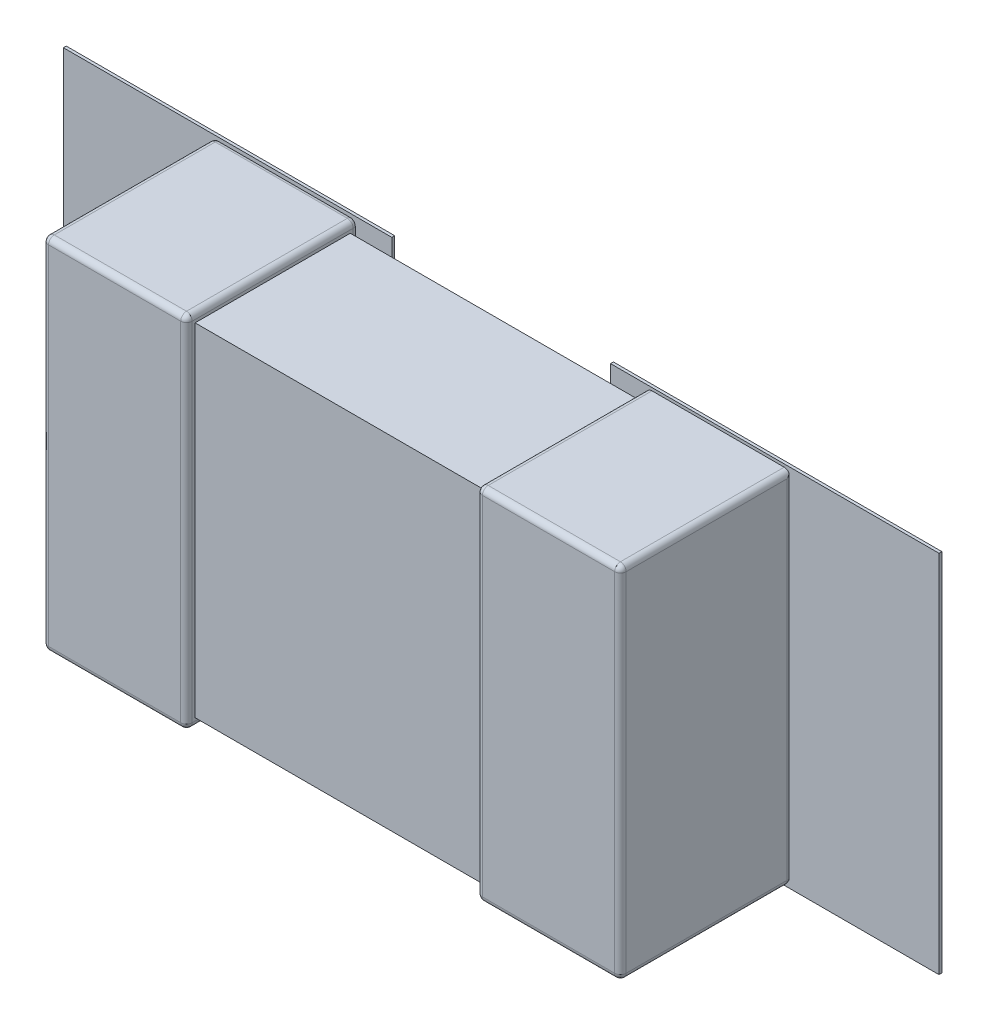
ISO-10303-21;
HEADER;
FILE_DESCRIPTION(('STEP AP214'),'2;1');
FILE_NAME('part.step','',(''),(''),'','','');
FILE_SCHEMA(('AUTOMOTIVE_DESIGN { 1 0 10303 214 1 1 1 1 }'));
ENDSEC;
DATA;
#1=APPLICATION_CONTEXT('core data for automotive mechanical design processes');
#2=APPLICATION_PROTOCOL_DEFINITION('international standard','automotive_design',2000,#1);
#3=PRODUCT_CONTEXT('',#1,'mechanical');
#4=PRODUCT('Part','Part','',(#3));
#5=PRODUCT_RELATED_PRODUCT_CATEGORY('part','',(#4));
#6=PRODUCT_DEFINITION_FORMATION('','',#4);
#7=PRODUCT_DEFINITION_CONTEXT('part definition',#1,'design');
#8=PRODUCT_DEFINITION('design','',#6,#7);
#9=PRODUCT_DEFINITION_SHAPE('','',#8);
#10=(LENGTH_UNIT() NAMED_UNIT(*) SI_UNIT(.MILLI.,.METRE.));
#11=(NAMED_UNIT(*) PLANE_ANGLE_UNIT() SI_UNIT($,.RADIAN.));
#12=(NAMED_UNIT(*) SI_UNIT($,.STERADIAN.) SOLID_ANGLE_UNIT());
#13=UNCERTAINTY_MEASURE_WITH_UNIT(LENGTH_MEASURE(1.E-05),#10,'distance_accuracy_value','');
#14=(GEOMETRIC_REPRESENTATION_CONTEXT(3) GLOBAL_UNCERTAINTY_ASSIGNED_CONTEXT((#13)) GLOBAL_UNIT_ASSIGNED_CONTEXT((#10,
#11,#12)) REPRESENTATION_CONTEXT('',''));
#15=CARTESIAN_POINT('',(0.,0.,0.));
#16=DIRECTION('',(0.,0.,1.));
#17=DIRECTION('',(1.,0.,0.));
#18=AXIS2_PLACEMENT_3D('',#15,#16,#17);
#19=CARTESIAN_POINT('',(0.98495100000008,-0.60496700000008,0.65614800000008));
#20=DIRECTION('',(0.707106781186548,0.,0.707106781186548));
#21=DIRECTION('',(0.,-1.,0.));
#22=AXIS2_PLACEMENT_3D('',#19,#20,#21);
#23=SPHERICAL_SURFACE('',#22,0.0199999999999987);
#24=CARTESIAN_POINT('',(0.98495100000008,-0.60496700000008,0.65614800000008));
#25=DIRECTION('',(1.,0.,0.));
#26=DIRECTION('',(0.,0.,-1.));
#27=AXIS2_PLACEMENT_3D('',#24,#25,#26);
#28=CIRCLE('',#27,0.0199999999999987);
#29=CARTESIAN_POINT('',(0.98495100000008,-0.624967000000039,0.65614800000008));
#30=VERTEX_POINT('',#29);
#31=CARTESIAN_POINT('',(0.98495100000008,-0.60496700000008,0.676148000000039));
#32=VERTEX_POINT('',#31);
#33=EDGE_CURVE('E392',#30,#32,#28,.F.);
#34=ORIENTED_EDGE('',*,*,#33,.F.);
#35=CARTESIAN_POINT('',(0.98495100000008,-0.60496700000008,0.65614800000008));
#36=DIRECTION('',(0.,0.,-1.));
#37=DIRECTION('',(-1.,0.,0.));
#38=AXIS2_PLACEMENT_3D('',#35,#36,#37);
#39=CIRCLE('',#38,0.0199999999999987);
#40=CARTESIAN_POINT('',(1.00495100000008,-0.60496700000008,0.65614800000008));
#41=VERTEX_POINT('',#40);
#42=EDGE_CURVE('E94',#41,#30,#39,.T.);
#43=ORIENTED_EDGE('',*,*,#42,.F.);
#44=CARTESIAN_POINT('',(0.98495100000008,-0.60496700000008,0.65614800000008));
#45=DIRECTION('',(0.,1.,0.));
#46=DIRECTION('',(0.,0.,1.));
#47=AXIS2_PLACEMENT_3D('',#44,#45,#46);
#48=CIRCLE('',#47,0.0199999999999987);
#49=CARTESIAN_POINT('',(0.99909313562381,-0.60496700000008,0.67029013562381));
#50=VERTEX_POINT('',#49);
#51=EDGE_CURVE('E54',#50,#41,#48,.T.);
#52=ORIENTED_EDGE('',*,*,#51,.F.);
#53=CARTESIAN_POINT('',(0.98495100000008,-0.60496700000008,0.65614800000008));
#54=DIRECTION('',(0.,1.,0.));
#55=DIRECTION('',(0.,0.,1.));
#56=AXIS2_PLACEMENT_3D('',#53,#54,#55);
#57=CIRCLE('',#56,0.0199999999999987);
#58=EDGE_CURVE('E35',#32,#50,#57,.T.);
#59=ORIENTED_EDGE('',*,*,#58,.F.);
#60=EDGE_LOOP('',(#34,#43,#52,#59));
#61=FACE_BOUND('',#60,.T.);
#62=ADVANCED_FACE('F16',(#61),#23,.T.);
#63=CARTESIAN_POINT('',(0.,0.,0.0762));
#64=DIRECTION('',(0.,0.,1.));
#65=DIRECTION('',(1.,0.,0.));
#66=AXIS2_PLACEMENT_3D('',#63,#64,#65);
#67=PLANE('',#66);
#68=DIRECTION('',(0.,1.,0.));
#69=VECTOR('',#68,1.);
#70=CARTESIAN_POINT('',(0.380500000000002,0.635,0.0762));
#71=LINE('',#70,#69);
#72=CARTESIAN_POINT('',(0.380500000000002,0.635,0.0762));
#73=VERTEX_POINT('',#72);
#74=CARTESIAN_POINT('',(0.380500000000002,-0.635,0.0762));
#75=VERTEX_POINT('',#74);
#76=EDGE_CURVE('E383',#73,#75,#71,.F.);
#77=ORIENTED_EDGE('',*,*,#76,.F.);
#78=DIRECTION('',(1.,0.,0.));
#79=VECTOR('',#78,1.);
#80=CARTESIAN_POINT('',(1.5235,0.635,0.0762));
#81=LINE('',#80,#79);
#82=CARTESIAN_POINT('',(1.5235,0.635,0.0762));
#83=VERTEX_POINT('',#82);
#84=EDGE_CURVE('E389',#83,#73,#81,.F.);
#85=ORIENTED_EDGE('',*,*,#84,.F.);
#86=DIRECTION('',(0.,1.,0.));
#87=VECTOR('',#86,1.);
#88=CARTESIAN_POINT('',(1.5235,-0.635,0.0762));
#89=LINE('',#88,#87);
#90=CARTESIAN_POINT('',(1.5235,-0.635,0.0762));
#91=VERTEX_POINT('',#90);
#92=EDGE_CURVE('E82',#91,#83,#89,.T.);
#93=ORIENTED_EDGE('',*,*,#92,.F.);
#94=DIRECTION('',(1.,0.,0.));
#95=VECTOR('',#94,1.);
#96=CARTESIAN_POINT('',(0.380500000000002,-0.635,0.0762));
#97=LINE('',#96,#95);
#98=EDGE_CURVE('E377',#75,#91,#97,.T.);
#99=ORIENTED_EDGE('',*,*,#98,.F.);
#100=EDGE_LOOP('',(#77,#85,#93,#99));
#101=FACE_BOUND('',#100,.T.);
#102=ADVANCED_FACE('F103',(#101),#67,.F.);
#103=CARTESIAN_POINT('',(0.98495100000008,0.60496700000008,0.65614800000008));
#104=DIRECTION('',(0.,0.707106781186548,0.707106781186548));
#105=DIRECTION('',(1.,0.,0.));
#106=AXIS2_PLACEMENT_3D('',#103,#104,#105);
#107=SPHERICAL_SURFACE('',#106,0.0199999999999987);
#108=CARTESIAN_POINT('',(0.98495100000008,0.60496700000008,0.65614800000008));
#109=DIRECTION('',(-1.,0.,0.));
#110=DIRECTION('',(0.,0.,1.));
#111=AXIS2_PLACEMENT_3D('',#108,#109,#110);
#112=CIRCLE('',#111,0.0199999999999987);
#113=CARTESIAN_POINT('',(0.98495100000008,0.61910913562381,0.67029013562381));
#114=VERTEX_POINT('',#113);
#115=CARTESIAN_POINT('',(0.98495100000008,0.624967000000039,0.65614800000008));
#116=VERTEX_POINT('',#115);
#117=EDGE_CURVE('E95',#114,#116,#112,.T.);
#118=ORIENTED_EDGE('',*,*,#117,.F.);
#119=CARTESIAN_POINT('',(0.98495100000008,0.60496700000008,0.65614800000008));
#120=DIRECTION('',(-1.,0.,0.));
#121=DIRECTION('',(0.,0.,1.));
#122=AXIS2_PLACEMENT_3D('',#119,#120,#121);
#123=CIRCLE('',#122,0.0199999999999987);
#124=CARTESIAN_POINT('',(0.98495100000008,0.60496700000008,0.676148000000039));
#125=VERTEX_POINT('',#124);
#126=EDGE_CURVE('E58',#125,#114,#123,.T.);
#127=ORIENTED_EDGE('',*,*,#126,.F.);
#128=CARTESIAN_POINT('',(0.98495100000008,0.60496700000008,0.65614800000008));
#129=DIRECTION('',(0.,1.,0.));
#130=DIRECTION('',(0.,0.,1.));
#131=AXIS2_PLACEMENT_3D('',#128,#129,#130);
#132=CIRCLE('',#131,0.0199999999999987);
#133=CARTESIAN_POINT('',(1.00495100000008,0.60496700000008,0.65614800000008));
#134=VERTEX_POINT('',#133);
#135=EDGE_CURVE('E20',#134,#125,#132,.F.);
#136=ORIENTED_EDGE('',*,*,#135,.F.);
#137=CARTESIAN_POINT('',(0.98495100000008,0.60496700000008,0.65614800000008));
#138=DIRECTION('',(0.,0.,-1.));
#139=DIRECTION('',(-1.,0.,0.));
#140=AXIS2_PLACEMENT_3D('',#137,#138,#139);
#141=CIRCLE('',#140,0.0199999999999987);
#142=EDGE_CURVE('E72',#116,#134,#141,.T.);
#143=ORIENTED_EDGE('',*,*,#142,.F.);
#144=EDGE_LOOP('',(#118,#127,#136,#143));
#145=FACE_BOUND('',#144,.T.);
#146=ADVANCED_FACE('F84',(#145),#107,.T.);
#147=CARTESIAN_POINT('',(1.004951,-0.624967,0.0762));
#148=DIRECTION('',(1.,0.,0.));
#149=DIRECTION('',(0.,0.,-1.));
#150=AXIS2_PLACEMENT_3D('',#147,#148,#149);
#151=PLANE('',#150);
#152=DIRECTION('',(0.,-1.,0.));
#153=VECTOR('',#152,1.);
#154=CARTESIAN_POINT('',(1.00495100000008,2.43846719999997,0.0961999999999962));
#155=LINE('',#154,#153);
#156=CARTESIAN_POINT('',(1.00495100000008,0.60496700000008,0.0961999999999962));
#157=VERTEX_POINT('',#156);
#158=CARTESIAN_POINT('',(1.00495100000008,-0.60496700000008,0.0961999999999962));
#159=VERTEX_POINT('',#158);
#160=EDGE_CURVE('E67',#157,#159,#155,.T.);
#161=ORIENTED_EDGE('',*,*,#160,.F.);
#162=DIRECTION('',(0.,0.,-1.));
#163=VECTOR('',#162,1.);
#164=CARTESIAN_POINT('',(1.00495100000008,0.60496700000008,1.4582402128));
#165=LINE('',#164,#163);
#166=EDGE_CURVE('E62',#134,#157,#165,.T.);
#167=ORIENTED_EDGE('',*,*,#166,.F.);
#168=DIRECTION('',(0.,1.,0.));
#169=VECTOR('',#168,1.);
#170=CARTESIAN_POINT('',(1.00495100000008,-2.43846719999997,0.65614800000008));
#171=LINE('',#170,#169);
#172=EDGE_CURVE('E49',#41,#134,#171,.T.);
#173=ORIENTED_EDGE('',*,*,#172,.F.);
#174=DIRECTION('',(0.,0.,-1.));
#175=VECTOR('',#174,1.);
#176=CARTESIAN_POINT('',(1.00495100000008,-0.60496700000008,1.4582402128));
#177=LINE('',#176,#175);
#178=EDGE_CURVE('E91',#159,#41,#177,.F.);
#179=ORIENTED_EDGE('',*,*,#178,.F.);
#180=EDGE_LOOP('',(#161,#167,#173,#179));
#181=FACE_BOUND('',#180,.T.);
#182=ADVANCED_FACE('F64',(#181),#151,.T.);
#183=CARTESIAN_POINT('',(0.98495100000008,-2.43846719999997,0.65614800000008));
#184=DIRECTION('',(0.,1.,0.));
#185=DIRECTION('',(0.,0.,1.));
#186=AXIS2_PLACEMENT_3D('',#183,#184,#185);
#187=CYLINDRICAL_SURFACE('',#186,0.0199999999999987);
#188=ORIENTED_EDGE('',*,*,#51,.T.);
#189=ORIENTED_EDGE('',*,*,#172,.T.);
#190=ORIENTED_EDGE('',*,*,#135,.T.);
#191=DIRECTION('',(0.,1.,0.));
#192=VECTOR('',#191,1.);
#193=CARTESIAN_POINT('',(0.98495100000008,0.,0.676148));
#194=LINE('',#193,#192);
#195=EDGE_CURVE('E89',#32,#125,#194,.T.);
#196=ORIENTED_EDGE('',*,*,#195,.F.);
#197=ORIENTED_EDGE('',*,*,#58,.T.);
#198=EDGE_LOOP('',(#188,#189,#190,#196,#197));
#199=FACE_BOUND('',#198,.T.);
#200=ADVANCED_FACE('F51',(#199),#187,.T.);
#201=CARTESIAN_POINT('',(5.4955692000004,0.60496700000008,0.65614800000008));
#202=DIRECTION('',(-1.,0.,0.));
#203=DIRECTION('',(0.,0.,1.));
#204=AXIS2_PLACEMENT_3D('',#201,#202,#203);
#205=CYLINDRICAL_SURFACE('',#204,0.0199999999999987);
#206=ORIENTED_EDGE('',*,*,#117,.T.);
#207=DIRECTION('',(1.,0.,0.));
#208=VECTOR('',#207,1.);
#209=CARTESIAN_POINT('',(1.004951,0.624967,0.65614800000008));
#210=LINE('',#209,#208);
#211=CARTESIAN_POINT('',(0.524950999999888,0.624967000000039,0.65614800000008));
#212=VERTEX_POINT('',#211);
#213=EDGE_CURVE('E415',#212,#116,#210,.T.);
#214=ORIENTED_EDGE('',*,*,#213,.F.);
#215=CARTESIAN_POINT('',(0.524950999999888,0.60496700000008,0.65614800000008));
#216=DIRECTION('',(-1.,0.,0.));
#217=DIRECTION('',(0.,0.,1.));
#218=AXIS2_PLACEMENT_3D('',#215,#216,#217);
#219=CIRCLE('',#218,0.0199999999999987);
#220=CARTESIAN_POINT('',(0.524950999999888,0.60496700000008,0.676148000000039));
#221=VERTEX_POINT('',#220);
#222=EDGE_CURVE('E416',#221,#212,#219,.T.);
#223=ORIENTED_EDGE('',*,*,#222,.F.);
#224=DIRECTION('',(1.,0.,0.));
#225=VECTOR('',#224,1.);
#226=CARTESIAN_POINT('',(0.,0.60496700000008,0.676148));
#227=LINE('',#226,#225);
#228=EDGE_CURVE('E420',#125,#221,#227,.F.);
#229=ORIENTED_EDGE('',*,*,#228,.F.);
#230=ORIENTED_EDGE('',*,*,#126,.T.);
#231=EDGE_LOOP('',(#206,#214,#223,#229,#230));
#232=FACE_BOUND('',#231,.T.);
#233=ADVANCED_FACE('F590',(#232),#205,.T.);
#234=CARTESIAN_POINT('',(0.98495100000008,-0.60496700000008,1.4582402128));
#235=DIRECTION('',(0.,0.,-1.));
#236=DIRECTION('',(-1.,0.,0.));
#237=AXIS2_PLACEMENT_3D('',#234,#235,#236);
#238=CYLINDRICAL_SURFACE('',#237,0.0199999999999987);
#239=ORIENTED_EDGE('',*,*,#42,.T.);
#240=DIRECTION('',(0.,0.,-1.));
#241=VECTOR('',#240,1.);
#242=CARTESIAN_POINT('',(0.98495100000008,-0.624967,0.0762));
#243=LINE('',#242,#241);
#244=CARTESIAN_POINT('',(0.98495100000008,-0.624967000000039,0.096199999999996));
#245=VERTEX_POINT('',#244);
#246=EDGE_CURVE('E393',#245,#30,#243,.F.);
#247=ORIENTED_EDGE('',*,*,#246,.F.);
#248=CARTESIAN_POINT('',(0.98495100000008,-0.60496700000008,0.0961999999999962));
#249=DIRECTION('',(0.,0.,-1.));
#250=DIRECTION('',(0.707106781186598,-0.707106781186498,0.));
#251=AXIS2_PLACEMENT_3D('',#248,#249,#250);
#252=CIRCLE('',#251,0.0199999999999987);
#253=CARTESIAN_POINT('',(0.999093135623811,-0.619109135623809,0.0961999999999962));
#254=VERTEX_POINT('',#253);
#255=EDGE_CURVE('E364',#254,#245,#252,.T.);
#256=ORIENTED_EDGE('',*,*,#255,.F.);
#257=CARTESIAN_POINT('',(0.98495100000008,-0.60496700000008,0.0961999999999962));
#258=DIRECTION('',(0.,0.,-1.));
#259=DIRECTION('',(-1.,0.,0.));
#260=AXIS2_PLACEMENT_3D('',#257,#258,#259);
#261=CIRCLE('',#260,0.0199999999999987);
#262=EDGE_CURVE('E368',#159,#254,#261,.T.);
#263=ORIENTED_EDGE('',*,*,#262,.F.);
#264=ORIENTED_EDGE('',*,*,#178,.T.);
#265=EDGE_LOOP('',(#239,#247,#256,#263,#264));
#266=FACE_BOUND('',#265,.T.);
#267=ADVANCED_FACE('F638',(#266),#238,.T.);
#268=CARTESIAN_POINT('',(-5.4955692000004,-0.60496700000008,0.65614800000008));
#269=DIRECTION('',(1.,0.,0.));
#270=DIRECTION('',(0.,0.,-1.));
#271=AXIS2_PLACEMENT_3D('',#268,#269,#270);
#272=CYLINDRICAL_SURFACE('',#271,0.0199999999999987);
#273=ORIENTED_EDGE('',*,*,#33,.T.);
#274=DIRECTION('',(1.,0.,0.));
#275=VECTOR('',#274,1.);
#276=CARTESIAN_POINT('',(0.,-0.60496700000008,0.676148));
#277=LINE('',#276,#275);
#278=CARTESIAN_POINT('',(0.524950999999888,-0.60496700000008,0.676148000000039));
#279=VERTEX_POINT('',#278);
#280=EDGE_CURVE('E491',#279,#32,#277,.T.);
#281=ORIENTED_EDGE('',*,*,#280,.F.);
#282=CARTESIAN_POINT('',(0.524950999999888,-0.60496700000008,0.65614800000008));
#283=DIRECTION('',(1.,0.,0.));
#284=DIRECTION('',(0.,0.,-1.));
#285=AXIS2_PLACEMENT_3D('',#282,#283,#284);
#286=CIRCLE('',#285,0.0199999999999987);
#287=CARTESIAN_POINT('',(0.524950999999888,-0.624967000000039,0.65614800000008));
#288=VERTEX_POINT('',#287);
#289=EDGE_CURVE('E395',#288,#279,#286,.F.);
#290=ORIENTED_EDGE('',*,*,#289,.F.);
#291=DIRECTION('',(1.,0.,0.));
#292=VECTOR('',#291,1.);
#293=CARTESIAN_POINT('',(-1.004951,-0.624967,0.65614800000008));
#294=LINE('',#293,#292);
#295=EDGE_CURVE('E419',#30,#288,#294,.F.);
#296=ORIENTED_EDGE('',*,*,#295,.F.);
#297=EDGE_LOOP('',(#273,#281,#290,#296));
#298=FACE_BOUND('',#297,.T.);
#299=ADVANCED_FACE('F647',(#298),#272,.T.);
#300=CARTESIAN_POINT('',(1.5235,0.635,0.0762));
#301=DIRECTION('',(0.,1.,0.));
#302=DIRECTION('',(0.,0.,1.));
#303=AXIS2_PLACEMENT_3D('',#300,#301,#302);
#304=PLANE('',#303);
#305=DIRECTION('',(0.,0.,-1.));
#306=VECTOR('',#305,1.);
#307=CARTESIAN_POINT('',(1.5235,0.635,0.0762));
#308=LINE('',#307,#306);
#309=CARTESIAN_POINT('',(1.5235,0.635,0.0862000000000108));
#310=VERTEX_POINT('',#309);
#311=EDGE_CURVE('E374',#83,#310,#308,.F.);
#312=ORIENTED_EDGE('',*,*,#311,.F.);
#313=ORIENTED_EDGE('',*,*,#84,.T.);
#314=DIRECTION('',(0.,0.,1.));
#315=VECTOR('',#314,1.);
#316=CARTESIAN_POINT('',(0.380500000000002,0.635,0.0762));
#317=LINE('',#316,#315);
#318=CARTESIAN_POINT('',(0.380500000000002,0.635,0.0862000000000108));
#319=VERTEX_POINT('',#318);
#320=EDGE_CURVE('E386',#319,#73,#317,.F.);
#321=ORIENTED_EDGE('',*,*,#320,.F.);
#322=DIRECTION('',(1.,0.,0.));
#323=VECTOR('',#322,1.);
#324=CARTESIAN_POINT('',(0.,0.635,0.0862000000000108));
#325=LINE('',#324,#323);
#326=EDGE_CURVE('E424',#310,#319,#325,.F.);
#327=ORIENTED_EDGE('',*,*,#326,.F.);
#328=EDGE_LOOP('',(#312,#313,#321,#327));
#329=FACE_BOUND('',#328,.T.);
#330=ADVANCED_FACE('F1408',(#329),#304,.T.);
#331=CARTESIAN_POINT('',(0.380500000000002,0.635,0.0762));
#332=DIRECTION('',(-1.,0.,0.));
#333=DIRECTION('',(0.,0.,1.));
#334=AXIS2_PLACEMENT_3D('',#331,#332,#333);
#335=PLANE('',#334);
#336=ORIENTED_EDGE('',*,*,#320,.T.);
#337=ORIENTED_EDGE('',*,*,#76,.T.);
#338=DIRECTION('',(0.,0.,-1.));
#339=VECTOR('',#338,1.);
#340=CARTESIAN_POINT('',(0.380500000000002,-0.635,0.0762));
#341=LINE('',#340,#339);
#342=CARTESIAN_POINT('',(0.380500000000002,-0.635,0.0862000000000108));
#343=VERTEX_POINT('',#342);
#344=EDGE_CURVE('E380',#343,#75,#341,.T.);
#345=ORIENTED_EDGE('',*,*,#344,.F.);
#346=DIRECTION('',(0.,1.,0.));
#347=VECTOR('',#346,1.);
#348=CARTESIAN_POINT('',(0.380500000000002,0.,0.0862000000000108));
#349=LINE('',#348,#347);
#350=EDGE_CURVE('E432',#319,#343,#349,.F.);
#351=ORIENTED_EDGE('',*,*,#350,.F.);
#352=EDGE_LOOP('',(#336,#337,#345,#351));
#353=FACE_BOUND('',#352,.T.);
#354=ADVANCED_FACE('F1503',(#353),#335,.T.);
#355=CARTESIAN_POINT('',(0.380500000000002,-0.635,0.0762));
#356=DIRECTION('',(0.,-1.,0.));
#357=DIRECTION('',(0.,0.,-1.));
#358=AXIS2_PLACEMENT_3D('',#355,#356,#357);
#359=PLANE('',#358);
#360=ORIENTED_EDGE('',*,*,#344,.T.);
#361=ORIENTED_EDGE('',*,*,#98,.T.);
#362=DIRECTION('',(0.,0.,-1.));
#363=VECTOR('',#362,1.);
#364=CARTESIAN_POINT('',(1.5235,-0.635,0.0762));
#365=LINE('',#364,#363);
#366=CARTESIAN_POINT('',(1.5235,-0.635,0.0862000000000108));
#367=VERTEX_POINT('',#366);
#368=EDGE_CURVE('E371',#367,#91,#365,.T.);
#369=ORIENTED_EDGE('',*,*,#368,.F.);
#370=DIRECTION('',(1.,0.,0.));
#371=VECTOR('',#370,1.);
#372=CARTESIAN_POINT('',(0.,-0.635,0.0862000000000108));
#373=LINE('',#372,#371);
#374=EDGE_CURVE('E440',#343,#367,#373,.T.);
#375=ORIENTED_EDGE('',*,*,#374,.F.);
#376=EDGE_LOOP('',(#360,#361,#369,#375));
#377=FACE_BOUND('',#376,.T.);
#378=ADVANCED_FACE('F1496',(#377),#359,.T.);
#379=CARTESIAN_POINT('',(1.5235,-0.635,0.0762));
#380=DIRECTION('',(1.,0.,0.));
#381=DIRECTION('',(0.,0.,-1.));
#382=AXIS2_PLACEMENT_3D('',#379,#380,#381);
#383=PLANE('',#382);
#384=ORIENTED_EDGE('',*,*,#368,.T.);
#385=ORIENTED_EDGE('',*,*,#92,.T.);
#386=ORIENTED_EDGE('',*,*,#311,.T.);
#387=DIRECTION('',(0.,1.,0.));
#388=VECTOR('',#387,1.);
#389=CARTESIAN_POINT('',(1.5235,0.,0.0862000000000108));
#390=LINE('',#389,#388);
#391=EDGE_CURVE('E518',#367,#310,#390,.T.);
#392=ORIENTED_EDGE('',*,*,#391,.F.);
#393=EDGE_LOOP('',(#384,#385,#386,#392));
#394=FACE_BOUND('',#393,.T.);
#395=ADVANCED_FACE('F1397',(#394),#383,.T.);
#396=CARTESIAN_POINT('',(0.98495100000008,0.60496700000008,1.4582402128));
#397=DIRECTION('',(0.,0.,-1.));
#398=DIRECTION('',(-1.,0.,0.));
#399=AXIS2_PLACEMENT_3D('',#396,#397,#398);
#400=CYLINDRICAL_SURFACE('',#399,0.0199999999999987);
#401=CARTESIAN_POINT('',(0.98495100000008,0.60496700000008,0.0961999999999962));
#402=DIRECTION('',(0.,-0.707106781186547,-0.707106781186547));
#403=DIRECTION('',(0.,-0.707106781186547,0.707106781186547));
#404=AXIS2_PLACEMENT_3D('',#401,#402,#403);
#405=ELLIPSE('',#404,0.0282842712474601,0.0199999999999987);
#406=CARTESIAN_POINT('',(1.00227150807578,0.614967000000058,0.0862000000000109));
#407=VERTEX_POINT('',#406);
#408=EDGE_CURVE('E71',#407,#157,#405,.T.);
#409=ORIENTED_EDGE('',*,*,#408,.F.);
#410=CARTESIAN_POINT('',(0.98495100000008,0.60496700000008,0.0862000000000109));
#411=DIRECTION('',(0.,0.,-1.));
#412=DIRECTION('',(-1.,0.,0.));
#413=AXIS2_PLACEMENT_3D('',#410,#411,#412);
#414=CIRCLE('',#413,0.0199999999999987);
#415=CARTESIAN_POINT('',(0.98495100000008,0.624967,0.0862000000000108));
#416=VERTEX_POINT('',#415);
#417=EDGE_CURVE('E347',#416,#407,#414,.T.);
#418=ORIENTED_EDGE('',*,*,#417,.F.);
#419=DIRECTION('',(0.,0.,1.));
#420=VECTOR('',#419,1.);
#421=CARTESIAN_POINT('',(0.98495100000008,0.624967,0.0762));
#422=LINE('',#421,#420);
#423=EDGE_CURVE('E79',#116,#416,#422,.F.);
#424=ORIENTED_EDGE('',*,*,#423,.F.);
#425=ORIENTED_EDGE('',*,*,#142,.T.);
#426=ORIENTED_EDGE('',*,*,#166,.T.);
#427=EDGE_LOOP('',(#409,#418,#424,#425,#426));
#428=FACE_BOUND('',#427,.T.);
#429=ADVANCED_FACE('F76',(#428),#400,.T.);
#430=CARTESIAN_POINT('',(0.98495100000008,2.43846719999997,0.0961999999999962));
#431=DIRECTION('',(0.,-1.,0.));
#432=DIRECTION('',(0.,0.,-1.));
#433=AXIS2_PLACEMENT_3D('',#430,#431,#432);
#434=CYLINDRICAL_SURFACE('',#433,0.0199999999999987);
#435=CARTESIAN_POINT('',(0.98495100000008,-0.60496700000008,0.0961999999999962));
#436=DIRECTION('',(0.,-1.,0.));
#437=DIRECTION('',(0.,0.,-1.));
#438=AXIS2_PLACEMENT_3D('',#435,#436,#437);
#439=CIRCLE('',#438,0.0199999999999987);
#440=CARTESIAN_POINT('',(1.00227150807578,-0.60496700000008,0.0862000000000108));
#441=VERTEX_POINT('',#440);
#442=EDGE_CURVE('E96',#441,#159,#439,.T.);
#443=ORIENTED_EDGE('',*,*,#442,.F.);
#444=DIRECTION('',(0.,1.,0.));
#445=VECTOR('',#444,1.);
#446=CARTESIAN_POINT('',(1.00227150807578,0.,0.0862000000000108));
#447=LINE('',#446,#445);
#448=EDGE_CURVE('E346',#407,#441,#447,.F.);
#449=ORIENTED_EDGE('',*,*,#448,.F.);
#450=ORIENTED_EDGE('',*,*,#408,.T.);
#451=ORIENTED_EDGE('',*,*,#160,.T.);
#452=EDGE_LOOP('',(#443,#449,#450,#451));
#453=FACE_BOUND('',#452,.T.);
#454=ADVANCED_FACE('F356',(#453),#434,.T.);
#455=CARTESIAN_POINT('',(0.98495100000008,-0.60496700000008,0.0961999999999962));
#456=DIRECTION('',(0.707106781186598,-0.707106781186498,0.));
#457=DIRECTION('',(0.,0.,-1.));
#458=AXIS2_PLACEMENT_3D('',#455,#456,#457);
#459=SPHERICAL_SURFACE('',#458,0.0199999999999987);
#460=CARTESIAN_POINT('',(0.98495100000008,-0.60496700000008,0.0961999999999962));
#461=DIRECTION('',(-1.,0.,0.));
#462=DIRECTION('',(0.,0.,1.));
#463=AXIS2_PLACEMENT_3D('',#460,#461,#462);
#464=CIRCLE('',#463,0.0199999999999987);
#465=CARTESIAN_POINT('',(0.98495100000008,-0.62228750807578,0.0862000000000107));
#466=VERTEX_POINT('',#465);
#467=EDGE_CURVE('E367',#466,#245,#464,.T.);
#468=ORIENTED_EDGE('',*,*,#467,.F.);
#469=CARTESIAN_POINT('',(1.00227150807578,-0.60496700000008,0.0862000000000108));
#470=CARTESIAN_POINT('',(1.00228438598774,-0.60691927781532,0.0862000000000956));
#471=CARTESIAN_POINT('',(1.00194331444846,-0.608863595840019,0.0862000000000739));
#472=CARTESIAN_POINT('',(1.00064694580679,-0.612536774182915,0.0862000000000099));
#473=CARTESIAN_POINT('',(0.999691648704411,-0.614265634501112,0.0861999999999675));
#474=CARTESIAN_POINT('',(0.99726050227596,-0.617308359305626,0.0862000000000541));
#475=CARTESIAN_POINT('',(0.995784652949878,-0.618622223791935,0.086200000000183));
#476=CARTESIAN_POINT('',(0.992479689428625,-0.620685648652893,0.0862000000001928));
#477=CARTESIAN_POINT('',(0.990650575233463,-0.621435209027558,0.0862000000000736));
#478=CARTESIAN_POINT('',(0.987505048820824,-0.622147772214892,0.0861999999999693));
#479=CARTESIAN_POINT('',(0.986227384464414,-0.622292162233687,0.0861999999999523));
#480=CARTESIAN_POINT('',(0.98495100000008,-0.622287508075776,0.0862000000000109));
#481=B_SPLINE_CURVE_WITH_KNOTS('',3,(#469,#470,#471,#472,#473,#474,#475,#476,#477,#478,#479,
#480),.UNSPECIFIED.,.F.,.F.,(4,2,2,2,2,4),(0.,0.00581573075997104,0.0116314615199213,
0.0174471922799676,0.0232629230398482,0.0270884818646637),.UNSPECIFIED.);
#482=EDGE_CURVE('E338',#441,#466,#481,.T.);
#483=ORIENTED_EDGE('',*,*,#482,.F.);
#484=ORIENTED_EDGE('',*,*,#442,.T.);
#485=ORIENTED_EDGE('',*,*,#262,.T.);
#486=ORIENTED_EDGE('',*,*,#255,.T.);
#487=EDGE_LOOP('',(#468,#483,#484,#485,#486));
#488=FACE_BOUND('',#487,.T.);
#489=ADVANCED_FACE('F349',(#488),#459,.T.);
#490=CARTESIAN_POINT('',(5.4955692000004,-0.60496700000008,0.0961999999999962));
#491=DIRECTION('',(-1.,0.,0.));
#492=DIRECTION('',(0.,0.,1.));
#493=AXIS2_PLACEMENT_3D('',#490,#491,#492);
#494=CYLINDRICAL_SURFACE('',#493,0.0199999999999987);
#495=CARTESIAN_POINT('',(0.524950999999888,-0.60496700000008,0.0961999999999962));
#496=DIRECTION('',(-1.,0.,0.));
#497=DIRECTION('',(0.,0.,1.));
#498=AXIS2_PLACEMENT_3D('',#495,#496,#497);
#499=CIRCLE('',#498,0.0199999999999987);
#500=CARTESIAN_POINT('',(0.524950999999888,-0.62228750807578,0.0862000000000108));
#501=VERTEX_POINT('',#500);
#502=CARTESIAN_POINT('',(0.524950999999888,-0.624967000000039,0.0961999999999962));
#503=VERTEX_POINT('',#502);
#504=EDGE_CURVE('E422',#501,#503,#499,.T.);
#505=ORIENTED_EDGE('',*,*,#504,.F.);
#506=DIRECTION('',(1.,0.,0.));
#507=VECTOR('',#506,1.);
#508=CARTESIAN_POINT('',(0.,-0.622287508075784,0.0862000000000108));
#509=LINE('',#508,#507);
#510=EDGE_CURVE('E345',#466,#501,#509,.F.);
#511=ORIENTED_EDGE('',*,*,#510,.F.);
#512=ORIENTED_EDGE('',*,*,#467,.T.);
#513=DIRECTION('',(1.,0.,0.));
#514=VECTOR('',#513,1.);
#515=CARTESIAN_POINT('',(-1.004951,-0.624967,0.0961999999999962));
#516=LINE('',#515,#514);
#517=EDGE_CURVE('E396',#503,#245,#516,.T.);
#518=ORIENTED_EDGE('',*,*,#517,.F.);
#519=EDGE_LOOP('',(#505,#511,#512,#518));
#520=FACE_BOUND('',#519,.T.);
#521=ADVANCED_FACE('F355',(#520),#494,.T.);
#522=CARTESIAN_POINT('',(1.004951,0.624967,0.0762));
#523=DIRECTION('',(0.,1.,0.));
#524=DIRECTION('',(0.,0.,1.));
#525=AXIS2_PLACEMENT_3D('',#522,#523,#524);
#526=PLANE('',#525);
#527=ORIENTED_EDGE('',*,*,#423,.T.);
#528=DIRECTION('',(1.,0.,0.));
#529=VECTOR('',#528,1.);
#530=CARTESIAN_POINT('',(0.,0.624967,0.0862000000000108));
#531=LINE('',#530,#529);
#532=CARTESIAN_POINT('',(0.524950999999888,0.624967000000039,0.0862000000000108));
#533=VERTEX_POINT('',#532);
#534=EDGE_CURVE('E507',#533,#416,#531,.T.);
#535=ORIENTED_EDGE('',*,*,#534,.F.);
#536=DIRECTION('',(0.,0.,1.));
#537=VECTOR('',#536,1.);
#538=CARTESIAN_POINT('',(0.524950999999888,0.624967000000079,-0.7058922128));
#539=LINE('',#538,#537);
#540=EDGE_CURVE('E496',#212,#533,#539,.F.);
#541=ORIENTED_EDGE('',*,*,#540,.F.);
#542=ORIENTED_EDGE('',*,*,#213,.T.);
#543=EDGE_LOOP('',(#527,#535,#541,#542));
#544=FACE_BOUND('',#543,.T.);
#545=ADVANCED_FACE('F505',(#544),#526,.T.);
#546=CARTESIAN_POINT('',(0.,0.,0.676148));
#547=DIRECTION('',(0.,0.,1.));
#548=DIRECTION('',(1.,0.,0.));
#549=AXIS2_PLACEMENT_3D('',#546,#547,#548);
#550=PLANE('',#549);
#551=ORIENTED_EDGE('',*,*,#195,.T.);
#552=ORIENTED_EDGE('',*,*,#228,.T.);
#553=DIRECTION('',(0.,-1.,0.));
#554=VECTOR('',#553,1.);
#555=CARTESIAN_POINT('',(0.524950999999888,2.43846719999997,0.676148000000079));
#556=LINE('',#555,#554);
#557=EDGE_CURVE('E489',#279,#221,#556,.F.);
#558=ORIENTED_EDGE('',*,*,#557,.F.);
#559=ORIENTED_EDGE('',*,*,#280,.T.);
#560=EDGE_LOOP('',(#551,#552,#558,#559));
#561=FACE_BOUND('',#560,.T.);
#562=ADVANCED_FACE('F484',(#561),#550,.T.);
#563=CARTESIAN_POINT('',(0.524950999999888,0.60496700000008,0.65614800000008));
#564=DIRECTION('',(-0.707106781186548,0.,0.707106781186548));
#565=DIRECTION('',(0.,1.,0.));
#566=AXIS2_PLACEMENT_3D('',#563,#564,#565);
#567=SPHERICAL_SURFACE('',#566,0.0199999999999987);
#568=ORIENTED_EDGE('',*,*,#222,.T.);
#569=CARTESIAN_POINT('',(0.524950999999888,0.60496700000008,0.65614800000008));
#570=DIRECTION('',(0.,0.,1.));
#571=DIRECTION('',(1.,0.,0.));
#572=AXIS2_PLACEMENT_3D('',#569,#570,#571);
#573=CIRCLE('',#572,0.0199999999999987);
#574=CARTESIAN_POINT('',(0.504950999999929,0.60496700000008,0.65614800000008));
#575=VERTEX_POINT('',#574);
#576=EDGE_CURVE('E499',#575,#212,#573,.F.);
#577=ORIENTED_EDGE('',*,*,#576,.F.);
#578=CARTESIAN_POINT('',(0.524950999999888,0.60496700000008,0.65614800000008));
#579=DIRECTION('',(0.,-1.,0.));
#580=DIRECTION('',(0.,0.,-1.));
#581=AXIS2_PLACEMENT_3D('',#578,#579,#580);
#582=CIRCLE('',#581,0.0199999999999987);
#583=CARTESIAN_POINT('',(0.510808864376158,0.60496700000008,0.67029013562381));
#584=VERTEX_POINT('',#583);
#585=EDGE_CURVE('E530',#584,#575,#582,.T.);
#586=ORIENTED_EDGE('',*,*,#585,.F.);
#587=CARTESIAN_POINT('',(0.524950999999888,0.60496700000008,0.65614800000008));
#588=DIRECTION('',(0.,-1.,0.));
#589=DIRECTION('',(0.,0.,-1.));
#590=AXIS2_PLACEMENT_3D('',#587,#588,#589);
#591=CIRCLE('',#590,0.0199999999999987);
#592=EDGE_CURVE('E527',#221,#584,#591,.T.);
#593=ORIENTED_EDGE('',*,*,#592,.F.);
#594=EDGE_LOOP('',(#568,#577,#586,#593));
#595=FACE_BOUND('',#594,.T.);
#596=ADVANCED_FACE('F479',(#595),#567,.T.);
#597=CARTESIAN_POINT('',(-1.004951,-0.624967,0.0762));
#598=DIRECTION('',(0.,-1.,0.));
#599=DIRECTION('',(0.,0.,-1.));
#600=AXIS2_PLACEMENT_3D('',#597,#598,#599);
#601=PLANE('',#600);
#602=ORIENTED_EDGE('',*,*,#517,.T.);
#603=ORIENTED_EDGE('',*,*,#246,.T.);
#604=ORIENTED_EDGE('',*,*,#295,.T.);
#605=DIRECTION('',(0.,0.,-1.));
#606=VECTOR('',#605,1.);
#607=CARTESIAN_POINT('',(0.524950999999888,-0.624967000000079,1.4582402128));
#608=LINE('',#607,#606);
#609=EDGE_CURVE('E464',#503,#288,#608,.F.);
#610=ORIENTED_EDGE('',*,*,#609,.F.);
#611=EDGE_LOOP('',(#602,#603,#604,#610));
#612=FACE_BOUND('',#611,.T.);
#613=ADVANCED_FACE('F475',(#612),#601,.T.);
#614=CARTESIAN_POINT('',(0.524950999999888,-0.60496700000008,0.65614800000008));
#615=DIRECTION('',(-0.707106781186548,-0.707106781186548,0.));
#616=DIRECTION('',(0.,0.,1.));
#617=AXIS2_PLACEMENT_3D('',#614,#615,#616);
#618=SPHERICAL_SURFACE('',#617,0.0199999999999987);
#619=ORIENTED_EDGE('',*,*,#289,.T.);
#620=CARTESIAN_POINT('',(0.524950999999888,-0.60496700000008,0.65614800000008));
#621=DIRECTION('',(0.,-1.,0.));
#622=DIRECTION('',(0.,0.,-1.));
#623=AXIS2_PLACEMENT_3D('',#620,#621,#622);
#624=CIRCLE('',#623,0.0199999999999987);
#625=CARTESIAN_POINT('',(0.504950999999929,-0.60496700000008,0.65614800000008));
#626=VERTEX_POINT('',#625);
#627=EDGE_CURVE('E468',#626,#279,#624,.F.);
#628=ORIENTED_EDGE('',*,*,#627,.F.);
#629=CARTESIAN_POINT('',(0.524950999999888,-0.60496700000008,0.65614800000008));
#630=DIRECTION('',(0.,0.,-1.));
#631=DIRECTION('',(-1.,0.,0.));
#632=AXIS2_PLACEMENT_3D('',#629,#630,#631);
#633=CIRCLE('',#632,0.0199999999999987);
#634=CARTESIAN_POINT('',(0.510808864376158,-0.61910913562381,0.65614800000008));
#635=VERTEX_POINT('',#634);
#636=EDGE_CURVE('E533',#635,#626,#633,.T.);
#637=ORIENTED_EDGE('',*,*,#636,.F.);
#638=CARTESIAN_POINT('',(0.524950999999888,-0.60496700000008,0.65614800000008));
#639=DIRECTION('',(0.,0.,-1.));
#640=DIRECTION('',(-1.,0.,0.));
#641=AXIS2_PLACEMENT_3D('',#638,#639,#640);
#642=CIRCLE('',#641,0.0199999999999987);
#643=EDGE_CURVE('E467',#288,#635,#642,.T.);
#644=ORIENTED_EDGE('',*,*,#643,.F.);
#645=EDGE_LOOP('',(#619,#628,#637,#644));
#646=FACE_BOUND('',#645,.T.);
#647=ADVANCED_FACE('F472',(#646),#618,.T.);
#648=CARTESIAN_POINT('',(0.524950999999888,-0.60496700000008,0.0961999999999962));
#649=DIRECTION('',(-0.707106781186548,0.,-0.707106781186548));
#650=DIRECTION('',(0.,-1.,0.));
#651=AXIS2_PLACEMENT_3D('',#648,#649,#650);
#652=SPHERICAL_SURFACE('',#651,0.0199999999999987);
#653=CARTESIAN_POINT('',(0.524950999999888,-0.60496700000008,0.0961999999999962));
#654=DIRECTION('',(0.,1.,0.));
#655=DIRECTION('',(0.,0.,1.));
#656=AXIS2_PLACEMENT_3D('',#653,#654,#655);
#657=CIRCLE('',#656,0.0199999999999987);
#658=CARTESIAN_POINT('',(0.507630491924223,-0.60496700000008,0.0861999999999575));
#659=VERTEX_POINT('',#658);
#660=CARTESIAN_POINT('',(0.504950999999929,-0.60496700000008,0.0961999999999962));
#661=VERTEX_POINT('',#660);
#662=EDGE_CURVE('E449',#659,#661,#657,.T.);
#663=ORIENTED_EDGE('',*,*,#662,.F.);
#664=CARTESIAN_POINT('',(0.524950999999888,-0.622287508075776,0.0862000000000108));
#665=CARTESIAN_POINT('',(0.522998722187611,-0.622300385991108,0.0862000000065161));
#666=CARTESIAN_POINT('',(0.521054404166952,-0.621959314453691,0.0862000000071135));
#667=CARTESIAN_POINT('',(0.517381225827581,-0.620662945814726,0.0862000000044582));
#668=CARTESIAN_POINT('',(0.515652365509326,-0.619707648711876,0.0862000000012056));
#669=CARTESIAN_POINT('',(0.512609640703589,-0.617276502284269,0.086199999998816));
#670=CARTESIAN_POINT('',(0.511295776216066,-0.615800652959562,0.0861999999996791));
#671=CARTESIAN_POINT('',(0.509232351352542,-0.612495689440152,0.0862000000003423));
#672=CARTESIAN_POINT('',(0.508482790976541,-0.610666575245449,0.0862000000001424));
#673=CARTESIAN_POINT('',(0.507770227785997,-0.607521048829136,0.0861999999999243));
#674=CARTESIAN_POINT('',(0.507625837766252,-0.606243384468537,0.0861999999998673));
#675=CARTESIAN_POINT('',(0.507630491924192,-0.60496700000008,0.0862000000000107));
#676=B_SPLINE_CURVE_WITH_KNOTS('',3,(#664,#665,#666,#667,#668,#669,#670,#671,#672,#673,#674,
#675),.UNSPECIFIED.,.F.,.F.,(4,2,2,2,2,4),(0.,0.00581573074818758,0.0116314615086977,
0.0174471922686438,0.0232629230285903,0.027088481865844),.UNSPECIFIED.);
#677=EDGE_CURVE('E332',#501,#659,#676,.T.);
#678=ORIENTED_EDGE('',*,*,#677,.F.);
#679=ORIENTED_EDGE('',*,*,#504,.T.);
#680=CARTESIAN_POINT('',(0.524950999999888,-0.60496700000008,0.0961999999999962));
#681=DIRECTION('',(0.,0.,-1.));
#682=DIRECTION('',(-1.,0.,0.));
#683=AXIS2_PLACEMENT_3D('',#680,#681,#682);
#684=CIRCLE('',#683,0.0199999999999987);
#685=EDGE_CURVE('E452',#661,#503,#684,.F.);
#686=ORIENTED_EDGE('',*,*,#685,.F.);
#687=EDGE_LOOP('',(#663,#678,#679,#686));
#688=FACE_BOUND('',#687,.T.);
#689=ADVANCED_FACE('F325',(#688),#652,.T.);
#690=CARTESIAN_POINT('',(0.,0.,0.0862000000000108));
#691=DIRECTION('',(0.,0.,1.));
#692=DIRECTION('',(1.,0.,0.));
#693=AXIS2_PLACEMENT_3D('',#690,#691,#692);
#694=PLANE('',#693);
#695=CARTESIAN_POINT('',(0.524950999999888,0.60496700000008,0.0862000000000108));
#696=DIRECTION('',(0.,0.,1.));
#697=DIRECTION('',(1.,0.,0.));
#698=AXIS2_PLACEMENT_3D('',#695,#696,#697);
#699=CIRCLE('',#698,0.0199999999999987);
#700=CARTESIAN_POINT('',(0.507630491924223,0.614967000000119,0.0861999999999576));
#701=VERTEX_POINT('',#700);
#702=EDGE_CURVE('E498',#533,#701,#699,.T.);
#703=ORIENTED_EDGE('',*,*,#702,.F.);
#704=ORIENTED_EDGE('',*,*,#534,.T.);
#705=ORIENTED_EDGE('',*,*,#417,.T.);
#706=ORIENTED_EDGE('',*,*,#448,.T.);
#707=ORIENTED_EDGE('',*,*,#482,.T.);
#708=ORIENTED_EDGE('',*,*,#510,.T.);
#709=ORIENTED_EDGE('',*,*,#677,.T.);
#710=DIRECTION('',(0.,1.,0.));
#711=VECTOR('',#710,1.);
#712=CARTESIAN_POINT('',(0.507630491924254,-2.43846719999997,0.0861999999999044));
#713=LINE('',#712,#711);
#714=EDGE_CURVE('E444',#701,#659,#713,.F.);
#715=ORIENTED_EDGE('',*,*,#714,.F.);
#716=EDGE_LOOP('',(#703,#704,#705,#706,#707,#708,#709,#715));
#717=FACE_BOUND('',#716,.T.);
#718=ORIENTED_EDGE('',*,*,#374,.T.);
#719=ORIENTED_EDGE('',*,*,#391,.T.);
#720=ORIENTED_EDGE('',*,*,#326,.T.);
#721=ORIENTED_EDGE('',*,*,#350,.T.);
#722=EDGE_LOOP('',(#718,#719,#720,#721));
#723=FACE_BOUND('',#722,.T.);
#724=ADVANCED_FACE('F320',(#717,#723),#694,.T.);
#725=CARTESIAN_POINT('',(0.524950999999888,0.60496700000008,-0.7058922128));
#726=DIRECTION('',(0.,0.,1.));
#727=DIRECTION('',(1.,0.,0.));
#728=AXIS2_PLACEMENT_3D('',#725,#726,#727);
#729=CYLINDRICAL_SURFACE('',#728,0.0199999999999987);
#730=ORIENTED_EDGE('',*,*,#540,.T.);
#731=ORIENTED_EDGE('',*,*,#702,.T.);
#732=CARTESIAN_POINT('',(0.524950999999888,0.60496700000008,0.0961999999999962));
#733=DIRECTION('',(0.,0.707106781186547,0.707106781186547));
#734=DIRECTION('',(0.,0.707106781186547,-0.707106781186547));
#735=AXIS2_PLACEMENT_3D('',#732,#733,#734);
#736=ELLIPSE('',#735,0.0282842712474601,0.0199999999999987);
#737=CARTESIAN_POINT('',(0.504950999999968,0.60496700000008,0.0961999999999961));
#738=VERTEX_POINT('',#737);
#739=EDGE_CURVE('E448',#738,#701,#736,.F.);
#740=ORIENTED_EDGE('',*,*,#739,.F.);
#741=DIRECTION('',(0.,0.,-1.));
#742=VECTOR('',#741,1.);
#743=CARTESIAN_POINT('',(0.504950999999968,0.60496700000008,0.106200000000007));
#744=LINE('',#743,#742);
#745=EDGE_CURVE('E447',#738,#575,#744,.F.);
#746=ORIENTED_EDGE('',*,*,#745,.T.);
#747=ORIENTED_EDGE('',*,*,#576,.T.);
#748=EDGE_LOOP('',(#730,#731,#740,#746,#747));
#749=FACE_BOUND('',#748,.T.);
#750=ADVANCED_FACE('F316',(#749),#729,.T.);
#751=CARTESIAN_POINT('',(0.524950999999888,2.43846719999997,0.65614800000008));
#752=DIRECTION('',(0.,-1.,0.));
#753=DIRECTION('',(0.,0.,-1.));
#754=AXIS2_PLACEMENT_3D('',#751,#752,#753);
#755=CYLINDRICAL_SURFACE('',#754,0.0199999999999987);
#756=DIRECTION('',(0.,1.,0.));
#757=VECTOR('',#756,1.);
#758=CARTESIAN_POINT('',(0.504950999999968,-0.624967,0.65614800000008));
#759=LINE('',#758,#757);
#760=EDGE_CURVE('E455',#575,#626,#759,.F.);
#761=ORIENTED_EDGE('',*,*,#760,.T.);
#762=ORIENTED_EDGE('',*,*,#627,.T.);
#763=ORIENTED_EDGE('',*,*,#557,.T.);
#764=ORIENTED_EDGE('',*,*,#592,.T.);
#765=ORIENTED_EDGE('',*,*,#585,.T.);
#766=EDGE_LOOP('',(#761,#762,#763,#764,#765));
#767=FACE_BOUND('',#766,.T.);
#768=ADVANCED_FACE('F312',(#767),#755,.T.);
#769=CARTESIAN_POINT('',(0.524950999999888,-0.60496700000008,1.4582402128));
#770=DIRECTION('',(0.,0.,-1.));
#771=DIRECTION('',(-1.,0.,0.));
#772=AXIS2_PLACEMENT_3D('',#769,#770,#771);
#773=CYLINDRICAL_SURFACE('',#772,0.0199999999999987);
#774=DIRECTION('',(0.,0.,-1.));
#775=VECTOR('',#774,1.);
#776=CARTESIAN_POINT('',(0.504950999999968,-0.60496700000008,0.106200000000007));
#777=LINE('',#776,#775);
#778=EDGE_CURVE('E459',#626,#661,#777,.T.);
#779=ORIENTED_EDGE('',*,*,#778,.T.);
#780=ORIENTED_EDGE('',*,*,#685,.T.);
#781=ORIENTED_EDGE('',*,*,#609,.T.);
#782=ORIENTED_EDGE('',*,*,#643,.T.);
#783=ORIENTED_EDGE('',*,*,#636,.T.);
#784=EDGE_LOOP('',(#779,#780,#781,#782,#783));
#785=FACE_BOUND('',#784,.T.);
#786=ADVANCED_FACE('F308',(#785),#773,.T.);
#787=CARTESIAN_POINT('',(0.524950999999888,-2.43846719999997,0.0961999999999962));
#788=DIRECTION('',(0.,1.,0.));
#789=DIRECTION('',(0.,0.,1.));
#790=AXIS2_PLACEMENT_3D('',#787,#788,#789);
#791=CYLINDRICAL_SURFACE('',#790,0.0199999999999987);
#792=ORIENTED_EDGE('',*,*,#739,.T.);
#793=ORIENTED_EDGE('',*,*,#714,.T.);
#794=ORIENTED_EDGE('',*,*,#662,.T.);
#795=DIRECTION('',(0.,1.,0.));
#796=VECTOR('',#795,1.);
#797=CARTESIAN_POINT('',(0.504950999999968,-0.624967,0.0961999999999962));
#798=LINE('',#797,#796);
#799=EDGE_CURVE('E456',#661,#738,#798,.T.);
#800=ORIENTED_EDGE('',*,*,#799,.T.);
#801=EDGE_LOOP('',(#792,#793,#794,#800));
#802=FACE_BOUND('',#801,.T.);
#803=ADVANCED_FACE('F304',(#802),#791,.T.);
#804=CARTESIAN_POINT('',(0.,0.,0.676148));
#805=DIRECTION('',(0.,0.,1.));
#806=DIRECTION('',(1.,0.,0.));
#807=AXIS2_PLACEMENT_3D('',#804,#805,#806);
#808=PLANE('',#807);
#809=DIRECTION('',(0.,-1.,0.));
#810=VECTOR('',#809,1.);
#811=CARTESIAN_POINT('',(-0.98495100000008,2.43846719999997,0.676148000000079));
#812=LINE('',#811,#810);
#813=CARTESIAN_POINT('',(-0.98495100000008,-0.60496700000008,0.676148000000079));
#814=VERTEX_POINT('',#813);
#815=CARTESIAN_POINT('',(-0.98495100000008,0.604967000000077,0.676148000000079));
#816=VERTEX_POINT('',#815);
#817=EDGE_CURVE('E538',#814,#816,#812,.F.);
#818=ORIENTED_EDGE('',*,*,#817,.F.);
#819=DIRECTION('',(1.,0.,0.));
#820=VECTOR('',#819,1.);
#821=CARTESIAN_POINT('',(-5.4955692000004,-0.60496700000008,0.676148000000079));
#822=LINE('',#821,#820);
#823=CARTESIAN_POINT('',(-0.524950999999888,-0.60496700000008,0.676148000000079));
#824=VERTEX_POINT('',#823);
#825=EDGE_CURVE('E534',#824,#814,#822,.F.);
#826=ORIENTED_EDGE('',*,*,#825,.F.);
#827=DIRECTION('',(0.,1.,0.));
#828=VECTOR('',#827,1.);
#829=CARTESIAN_POINT('',(-0.524950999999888,-2.43846719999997,0.676148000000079));
#830=LINE('',#829,#828);
#831=CARTESIAN_POINT('',(-0.524950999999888,0.60496700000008,0.676148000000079));
#832=VERTEX_POINT('',#831);
#833=EDGE_CURVE('E291',#832,#824,#830,.F.);
#834=ORIENTED_EDGE('',*,*,#833,.F.);
#835=DIRECTION('',(-1.,0.,0.));
#836=VECTOR('',#835,1.);
#837=CARTESIAN_POINT('',(5.4955692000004,0.60496700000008,0.676148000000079));
#838=LINE('',#837,#836);
#839=EDGE_CURVE('E542',#816,#832,#838,.F.);
#840=ORIENTED_EDGE('',*,*,#839,.F.);
#841=EDGE_LOOP('',(#818,#826,#834,#840));
#842=FACE_BOUND('',#841,.T.);
#843=ADVANCED_FACE('F300',(#842),#808,.T.);
#844=CARTESIAN_POINT('',(0.504950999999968,-0.624967,0.106200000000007));
#845=DIRECTION('',(1.,0.,0.));
#846=DIRECTION('',(0.,0.,-1.));
#847=AXIS2_PLACEMENT_3D('',#844,#845,#846);
#848=PLANE('',#847);
#849=DIRECTION('',(0.,1.,0.));
#850=VECTOR('',#849,1.);
#851=CARTESIAN_POINT('',(0.504950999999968,0.624967,0.64614800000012));
#852=LINE('',#851,#850);
#853=CARTESIAN_POINT('',(0.504950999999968,0.59496700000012,0.64614800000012));
#854=VERTEX_POINT('',#853);
#855=CARTESIAN_POINT('',(0.504950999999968,-0.59496700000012,0.64614800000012));
#856=VERTEX_POINT('',#855);
#857=EDGE_CURVE('E964',#854,#856,#852,.F.);
#858=ORIENTED_EDGE('',*,*,#857,.T.);
#859=DIRECTION('',(0.,0.,1.));
#860=VECTOR('',#859,1.);
#861=CARTESIAN_POINT('',(0.504950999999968,-0.59496700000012,0.676148));
#862=LINE('',#861,#860);
#863=CARTESIAN_POINT('',(0.504950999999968,-0.59496700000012,0.106200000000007));
#864=VERTEX_POINT('',#863);
#865=EDGE_CURVE('E979',#856,#864,#862,.F.);
#866=ORIENTED_EDGE('',*,*,#865,.T.);
#867=DIRECTION('',(0.,1.,0.));
#868=VECTOR('',#867,1.);
#869=CARTESIAN_POINT('',(0.504950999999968,-0.624967,0.106200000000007));
#870=LINE('',#869,#868);
#871=CARTESIAN_POINT('',(0.504950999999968,0.59496700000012,0.106200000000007));
#872=VERTEX_POINT('',#871);
#873=EDGE_CURVE('E975',#864,#872,#870,.T.);
#874=ORIENTED_EDGE('',*,*,#873,.T.);
#875=DIRECTION('',(0.,0.,-1.));
#876=VECTOR('',#875,1.);
#877=CARTESIAN_POINT('',(0.504950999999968,0.59496700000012,0.0762));
#878=LINE('',#877,#876);
#879=EDGE_CURVE('E970',#872,#854,#878,.F.);
#880=ORIENTED_EDGE('',*,*,#879,.T.);
#881=EDGE_LOOP('',(#858,#866,#874,#880));
#882=FACE_BOUND('',#881,.T.);
#883=ORIENTED_EDGE('',*,*,#778,.F.);
#884=ORIENTED_EDGE('',*,*,#760,.F.);
#885=ORIENTED_EDGE('',*,*,#745,.F.);
#886=ORIENTED_EDGE('',*,*,#799,.F.);
#887=EDGE_LOOP('',(#883,#884,#885,#886));
#888=FACE_BOUND('',#887,.T.);
#889=ADVANCED_FACE('F296',(#882,#888),#848,.F.);
#890=CARTESIAN_POINT('',(-0.524950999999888,-0.60496700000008,0.65614800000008));
#891=DIRECTION('',(0.707106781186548,0.,0.707106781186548));
#892=DIRECTION('',(0.,-1.,0.));
#893=AXIS2_PLACEMENT_3D('',#890,#891,#892);
#894=SPHERICAL_SURFACE('',#893,0.0199999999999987);
#895=CARTESIAN_POINT('',(-0.524950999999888,-0.60496700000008,0.65614800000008));
#896=DIRECTION('',(0.,1.,0.));
#897=DIRECTION('',(0.,0.,1.));
#898=AXIS2_PLACEMENT_3D('',#895,#896,#897);
#899=CIRCLE('',#898,0.0199999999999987);
#900=CARTESIAN_POINT('',(-0.510808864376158,-0.60496700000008,0.67029013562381));
#901=VERTEX_POINT('',#900);
#902=CARTESIAN_POINT('',(-0.504950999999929,-0.60496700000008,0.65614800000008));
#903=VERTEX_POINT('',#902);
#904=EDGE_CURVE('E932',#901,#903,#899,.T.);
#905=ORIENTED_EDGE('',*,*,#904,.F.);
#906=CARTESIAN_POINT('',(-0.524950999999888,-0.60496700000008,0.65614800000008));
#907=DIRECTION('',(0.,1.,0.));
#908=DIRECTION('',(0.,0.,1.));
#909=AXIS2_PLACEMENT_3D('',#906,#907,#908);
#910=CIRCLE('',#909,0.0199999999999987);
#911=EDGE_CURVE('E552',#824,#901,#910,.T.);
#912=ORIENTED_EDGE('',*,*,#911,.F.);
#913=CARTESIAN_POINT('',(-0.524950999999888,-0.60496700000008,0.65614800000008));
#914=DIRECTION('',(1.,0.,0.));
#915=DIRECTION('',(0.,0.,-1.));
#916=AXIS2_PLACEMENT_3D('',#913,#914,#915);
#917=CIRCLE('',#916,0.0199999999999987);
#918=CARTESIAN_POINT('',(-0.524950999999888,-0.624967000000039,0.65614800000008));
#919=VERTEX_POINT('',#918);
#920=EDGE_CURVE('E458',#919,#824,#917,.F.);
#921=ORIENTED_EDGE('',*,*,#920,.F.);
#922=CARTESIAN_POINT('',(-0.524950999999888,-0.60496700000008,0.65614800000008));
#923=DIRECTION('',(0.,0.,1.));
#924=DIRECTION('',(1.,0.,0.));
#925=AXIS2_PLACEMENT_3D('',#922,#923,#924);
#926=CIRCLE('',#925,0.0199999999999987);
#927=EDGE_CURVE('E927',#903,#919,#926,.F.);
#928=ORIENTED_EDGE('',*,*,#927,.F.);
#929=EDGE_LOOP('',(#905,#912,#921,#928));
#930=FACE_BOUND('',#929,.T.);
#931=ADVANCED_FACE('F293',(#930),#894,.T.);
#932=CARTESIAN_POINT('',(-5.4955692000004,-0.60496700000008,0.65614800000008));
#933=DIRECTION('',(1.,0.,0.));
#934=DIRECTION('',(0.,0.,-1.));
#935=AXIS2_PLACEMENT_3D('',#932,#933,#934);
#936=CYLINDRICAL_SURFACE('',#935,0.0199999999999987);
#937=CARTESIAN_POINT('',(-0.98495100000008,-0.60496700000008,0.65614800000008));
#938=DIRECTION('',(1.,0.,0.));
#939=DIRECTION('',(0.,0.,-1.));
#940=AXIS2_PLACEMENT_3D('',#937,#938,#939);
#941=CIRCLE('',#940,0.0199999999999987);
#942=CARTESIAN_POINT('',(-0.98495100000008,-0.624967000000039,0.65614800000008));
#943=VERTEX_POINT('',#942);
#944=EDGE_CURVE('E537',#943,#814,#941,.F.);
#945=ORIENTED_EDGE('',*,*,#944,.F.);
#946=DIRECTION('',(1.,0.,0.));
#947=VECTOR('',#946,1.);
#948=CARTESIAN_POINT('',(-1.004951,-0.624967,0.65614800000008));
#949=LINE('',#948,#947);
#950=EDGE_CURVE('E284',#919,#943,#949,.F.);
#951=ORIENTED_EDGE('',*,*,#950,.F.);
#952=ORIENTED_EDGE('',*,*,#920,.T.);
#953=ORIENTED_EDGE('',*,*,#825,.T.);
#954=EDGE_LOOP('',(#945,#951,#952,#953));
#955=FACE_BOUND('',#954,.T.);
#956=ADVANCED_FACE('F277',(#955),#936,.T.);
#957=CARTESIAN_POINT('',(-0.98495100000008,-0.60496700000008,0.65614800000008));
#958=DIRECTION('',(-0.707106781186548,-0.707106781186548,0.));
#959=DIRECTION('',(0.,0.,1.));
#960=AXIS2_PLACEMENT_3D('',#957,#958,#959);
#961=SPHERICAL_SURFACE('',#960,0.0199999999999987);
#962=CARTESIAN_POINT('',(-0.98495100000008,-0.60496700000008,0.65614800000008));
#963=DIRECTION('',(0.,0.,-1.));
#964=DIRECTION('',(-1.,0.,0.));
#965=AXIS2_PLACEMENT_3D('',#962,#963,#964);
#966=CIRCLE('',#965,0.0199999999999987);
#967=CARTESIAN_POINT('',(-0.99909313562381,-0.61910913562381,0.65614800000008));
#968=VERTEX_POINT('',#967);
#969=CARTESIAN_POINT('',(-1.00495100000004,-0.60496700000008,0.65614800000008));
#970=VERTEX_POINT('',#969);
#971=EDGE_CURVE('E924',#968,#970,#966,.T.);
#972=ORIENTED_EDGE('',*,*,#971,.F.);
#973=CARTESIAN_POINT('',(-0.98495100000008,-0.60496700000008,0.65614800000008));
#974=DIRECTION('',(0.,0.,-1.));
#975=DIRECTION('',(-1.,0.,0.));
#976=AXIS2_PLACEMENT_3D('',#973,#974,#975);
#977=CIRCLE('',#976,0.0199999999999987);
#978=EDGE_CURVE('E283',#943,#968,#977,.T.);
#979=ORIENTED_EDGE('',*,*,#978,.F.);
#980=ORIENTED_EDGE('',*,*,#944,.T.);
#981=CARTESIAN_POINT('',(-0.98495100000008,-0.60496700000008,0.65614800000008));
#982=DIRECTION('',(0.,-1.,0.));
#983=DIRECTION('',(0.,0.,-1.));
#984=AXIS2_PLACEMENT_3D('',#981,#982,#983);
#985=CIRCLE('',#984,0.0199999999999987);
#986=EDGE_CURVE('E541',#970,#814,#985,.F.);
#987=ORIENTED_EDGE('',*,*,#986,.F.);
#988=EDGE_LOOP('',(#972,#979,#980,#987));
#989=FACE_BOUND('',#988,.T.);
#990=ADVANCED_FACE('F272',(#989),#961,.T.);
#991=CARTESIAN_POINT('',(-0.98495100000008,2.43846719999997,0.65614800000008));
#992=DIRECTION('',(0.,-1.,0.));
#993=DIRECTION('',(0.,0.,-1.));
#994=AXIS2_PLACEMENT_3D('',#991,#992,#993);
#995=CYLINDRICAL_SURFACE('',#994,0.0199999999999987);
#996=ORIENTED_EDGE('',*,*,#986,.T.);
#997=ORIENTED_EDGE('',*,*,#817,.T.);
#998=CARTESIAN_POINT('',(-0.98495100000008,0.60496700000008,0.65614800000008));
#999=DIRECTION('',(2.96540569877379E-13,1.,2.96540569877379E-13));
#1000=DIRECTION('',(-0.707106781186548,0.,0.707106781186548));
#1001=AXIS2_PLACEMENT_3D('',#998,#999,#1000);
#1002=CIRCLE('',#1001,0.0199999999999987);
#1003=CARTESIAN_POINT('',(-0.99909313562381,0.60496700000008,0.67029013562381));
#1004=VERTEX_POINT('',#1003);
#1005=EDGE_CURVE('E263',#1004,#816,#1002,.T.);
#1006=ORIENTED_EDGE('',*,*,#1005,.F.);
#1007=CARTESIAN_POINT('',(-0.98495100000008,0.60496700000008,0.65614800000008));
#1008=DIRECTION('',(0.,-1.,0.));
#1009=DIRECTION('',(0.,0.,-1.));
#1010=AXIS2_PLACEMENT_3D('',#1007,#1008,#1009);
#1011=CIRCLE('',#1010,0.0199999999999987);
#1012=CARTESIAN_POINT('',(-1.00495100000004,0.60496700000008,0.65614800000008));
#1013=VERTEX_POINT('',#1012);
#1014=EDGE_CURVE('E540',#1013,#1004,#1011,.F.);
#1015=ORIENTED_EDGE('',*,*,#1014,.F.);
#1016=DIRECTION('',(0.,1.,0.));
#1017=VECTOR('',#1016,1.);
#1018=CARTESIAN_POINT('',(-1.004951,0.624967,0.65614800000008));
#1019=LINE('',#1018,#1017);
#1020=EDGE_CURVE('E926',#970,#1013,#1019,.T.);
#1021=ORIENTED_EDGE('',*,*,#1020,.F.);
#1022=EDGE_LOOP('',(#996,#997,#1006,#1015,#1021));
#1023=FACE_BOUND('',#1022,.T.);
#1024=ADVANCED_FACE('F268',(#1023),#995,.T.);
#1025=CARTESIAN_POINT('',(-0.98495100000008,0.60496700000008,0.65614800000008));
#1026=DIRECTION('',(-0.707106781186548,0.,0.707106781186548));
#1027=DIRECTION('',(0.,1.,0.));
#1028=AXIS2_PLACEMENT_3D('',#1025,#1026,#1027);
#1029=SPHERICAL_SURFACE('',#1028,0.0199999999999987);
#1030=ORIENTED_EDGE('',*,*,#1005,.T.);
#1031=CARTESIAN_POINT('',(-0.98495100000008,0.60496700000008,0.65614800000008));
#1032=DIRECTION('',(-1.,0.,0.));
#1033=DIRECTION('',(0.,0.,1.));
#1034=AXIS2_PLACEMENT_3D('',#1031,#1032,#1033);
#1035=CIRCLE('',#1034,0.0199999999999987);
#1036=CARTESIAN_POINT('',(-0.98495100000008,0.624967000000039,0.65614800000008));
#1037=VERTEX_POINT('',#1036);
#1038=EDGE_CURVE('E545',#1037,#816,#1035,.F.);
#1039=ORIENTED_EDGE('',*,*,#1038,.F.);
#1040=CARTESIAN_POINT('',(-0.98495100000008,0.60496700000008,0.65614800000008));
#1041=DIRECTION('',(0.,0.,-1.));
#1042=DIRECTION('',(-1.,0.,0.));
#1043=AXIS2_PLACEMENT_3D('',#1040,#1041,#1042);
#1044=CIRCLE('',#1043,0.0199999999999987);
#1045=EDGE_CURVE('E921',#1013,#1037,#1044,.T.);
#1046=ORIENTED_EDGE('',*,*,#1045,.F.);
#1047=ORIENTED_EDGE('',*,*,#1014,.T.);
#1048=EDGE_LOOP('',(#1030,#1039,#1046,#1047));
#1049=FACE_BOUND('',#1048,.T.);
#1050=ADVANCED_FACE('F265',(#1049),#1029,.T.);
#1051=CARTESIAN_POINT('',(5.4955692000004,0.60496700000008,0.65614800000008));
#1052=DIRECTION('',(-1.,0.,0.));
#1053=DIRECTION('',(0.,0.,1.));
#1054=AXIS2_PLACEMENT_3D('',#1051,#1052,#1053);
#1055=CYLINDRICAL_SURFACE('',#1054,0.0199999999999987);
#1056=ORIENTED_EDGE('',*,*,#1038,.T.);
#1057=ORIENTED_EDGE('',*,*,#839,.T.);
#1058=CARTESIAN_POINT('',(-0.524950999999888,0.60496700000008,0.65614800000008));
#1059=DIRECTION('',(-1.,0.,0.));
#1060=DIRECTION('',(0.,0.,1.));
#1061=AXIS2_PLACEMENT_3D('',#1058,#1059,#1060);
#1062=CIRCLE('',#1061,0.0199999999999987);
#1063=CARTESIAN_POINT('',(-0.524950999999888,0.624967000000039,0.65614800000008));
#1064=VERTEX_POINT('',#1063);
#1065=EDGE_CURVE('E544',#1064,#832,#1062,.F.);
#1066=ORIENTED_EDGE('',*,*,#1065,.F.);
#1067=DIRECTION('',(1.,0.,0.));
#1068=VECTOR('',#1067,1.);
#1069=CARTESIAN_POINT('',(1.004951,0.624967,0.65614800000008));
#1070=LINE('',#1069,#1068);
#1071=EDGE_CURVE('E259',#1037,#1064,#1070,.T.);
#1072=ORIENTED_EDGE('',*,*,#1071,.F.);
#1073=EDGE_LOOP('',(#1056,#1057,#1066,#1072));
#1074=FACE_BOUND('',#1073,.T.);
#1075=ADVANCED_FACE('F253',(#1074),#1055,.T.);
#1076=CARTESIAN_POINT('',(-0.524950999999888,0.60496700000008,0.65614800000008));
#1077=DIRECTION('',(0.707106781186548,0.707106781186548,0.));
#1078=DIRECTION('',(0.,0.,1.));
#1079=AXIS2_PLACEMENT_3D('',#1076,#1077,#1078);
#1080=SPHERICAL_SURFACE('',#1079,0.0199999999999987);
#1081=CARTESIAN_POINT('',(-0.524950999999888,0.60496700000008,0.65614800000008));
#1082=DIRECTION('',(0.,0.,-1.));
#1083=DIRECTION('',(-1.,0.,0.));
#1084=AXIS2_PLACEMENT_3D('',#1081,#1082,#1083);
#1085=CIRCLE('',#1084,0.0199999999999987);
#1086=CARTESIAN_POINT('',(-0.510808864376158,0.61910913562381,0.65614800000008));
#1087=VERTEX_POINT('',#1086);
#1088=EDGE_CURVE('E920',#1064,#1087,#1085,.T.);
#1089=ORIENTED_EDGE('',*,*,#1088,.F.);
#1090=ORIENTED_EDGE('',*,*,#1065,.T.);
#1091=CARTESIAN_POINT('',(-0.524950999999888,0.60496700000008,0.65614800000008));
#1092=DIRECTION('',(0.,1.,0.));
#1093=DIRECTION('',(0.,0.,1.));
#1094=AXIS2_PLACEMENT_3D('',#1091,#1092,#1093);
#1095=CIRCLE('',#1094,0.0199999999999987);
#1096=CARTESIAN_POINT('',(-0.504950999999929,0.60496700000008,0.65614800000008));
#1097=VERTEX_POINT('',#1096);
#1098=EDGE_CURVE('E930',#1097,#832,#1095,.F.);
#1099=ORIENTED_EDGE('',*,*,#1098,.F.);
#1100=CARTESIAN_POINT('',(-0.524950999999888,0.60496700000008,0.65614800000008));
#1101=DIRECTION('',(0.,0.,-1.));
#1102=DIRECTION('',(-1.,0.,0.));
#1103=AXIS2_PLACEMENT_3D('',#1100,#1101,#1102);
#1104=CIRCLE('',#1103,0.0199999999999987);
#1105=EDGE_CURVE('E917',#1087,#1097,#1104,.T.);
#1106=ORIENTED_EDGE('',*,*,#1105,.F.);
#1107=EDGE_LOOP('',(#1089,#1090,#1099,#1106));
#1108=FACE_BOUND('',#1107,.T.);
#1109=ADVANCED_FACE('F248',(#1108),#1080,.T.);
#1110=CARTESIAN_POINT('',(-0.524950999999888,-2.43846719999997,0.65614800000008));
#1111=DIRECTION('',(0.,1.,0.));
#1112=DIRECTION('',(0.,0.,1.));
#1113=AXIS2_PLACEMENT_3D('',#1110,#1111,#1112);
#1114=CYLINDRICAL_SURFACE('',#1113,0.0199999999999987);
#1115=ORIENTED_EDGE('',*,*,#1098,.T.);
#1116=ORIENTED_EDGE('',*,*,#833,.T.);
#1117=ORIENTED_EDGE('',*,*,#911,.T.);
#1118=ORIENTED_EDGE('',*,*,#904,.T.);
#1119=DIRECTION('',(0.,1.,0.));
#1120=VECTOR('',#1119,1.);
#1121=CARTESIAN_POINT('',(-0.504950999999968,-0.624967,0.65614800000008));
#1122=LINE('',#1121,#1120);
#1123=EDGE_CURVE('E940',#903,#1097,#1122,.T.);
#1124=ORIENTED_EDGE('',*,*,#1123,.T.);
#1125=EDGE_LOOP('',(#1115,#1116,#1117,#1118,#1124));
#1126=FACE_BOUND('',#1125,.T.);
#1127=ADVANCED_FACE('F244',(#1126),#1114,.T.);
#1128=CARTESIAN_POINT('',(-0.504950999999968,-0.59496700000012,0.676148));
#1129=DIRECTION('',(0.,1.,0.));
#1130=DIRECTION('',(0.,0.,1.));
#1131=AXIS2_PLACEMENT_3D('',#1128,#1129,#1130);
#1132=PLANE('',#1131);
#1133=DIRECTION('',(1.,0.,0.));
#1134=VECTOR('',#1133,1.);
#1135=CARTESIAN_POINT('',(-0.504950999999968,-0.59496700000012,0.106200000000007));
#1136=LINE('',#1135,#1134);
#1137=CARTESIAN_POINT('',(-0.504950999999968,-0.59496700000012,0.106200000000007));
#1138=VERTEX_POINT('',#1137);
#1139=EDGE_CURVE('E977',#1138,#864,#1136,.T.);
#1140=ORIENTED_EDGE('',*,*,#1139,.T.);
#1141=ORIENTED_EDGE('',*,*,#865,.F.);
#1142=DIRECTION('',(-1.,0.,0.));
#1143=VECTOR('',#1142,1.);
#1144=CARTESIAN_POINT('',(-0.504950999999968,-0.59496700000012,0.64614800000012));
#1145=LINE('',#1144,#1143);
#1146=CARTESIAN_POINT('',(-0.504950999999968,-0.59496700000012,0.64614800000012));
#1147=VERTEX_POINT('',#1146);
#1148=EDGE_CURVE('E929',#856,#1147,#1145,.T.);
#1149=ORIENTED_EDGE('',*,*,#1148,.T.);
#1150=DIRECTION('',(0.,0.,1.));
#1151=VECTOR('',#1150,1.);
#1152=CARTESIAN_POINT('',(-0.504950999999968,-0.59496700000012,0.0762));
#1153=LINE('',#1152,#1151);
#1154=EDGE_CURVE('E1018',#1147,#1138,#1153,.F.);
#1155=ORIENTED_EDGE('',*,*,#1154,.T.);
#1156=EDGE_LOOP('',(#1140,#1141,#1149,#1155));
#1157=FACE_BOUND('',#1156,.T.);
#1158=ADVANCED_FACE('F240',(#1157),#1132,.F.);
#1159=CARTESIAN_POINT('',(-0.504950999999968,-0.624967,0.106200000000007));
#1160=DIRECTION('',(0.,0.,1.));
#1161=DIRECTION('',(1.,0.,0.));
#1162=AXIS2_PLACEMENT_3D('',#1159,#1160,#1161);
#1163=PLANE('',#1162);
#1164=DIRECTION('',(1.,0.,0.));
#1165=VECTOR('',#1164,1.);
#1166=CARTESIAN_POINT('',(-0.504950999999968,0.59496700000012,0.106200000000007));
#1167=LINE('',#1166,#1165);
#1168=CARTESIAN_POINT('',(-0.504950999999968,0.59496700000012,0.106200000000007));
#1169=VERTEX_POINT('',#1168);
#1170=EDGE_CURVE('E972',#1169,#872,#1167,.T.);
#1171=ORIENTED_EDGE('',*,*,#1170,.T.);
#1172=ORIENTED_EDGE('',*,*,#873,.F.);
#1173=ORIENTED_EDGE('',*,*,#1139,.F.);
#1174=DIRECTION('',(0.,1.,0.));
#1175=VECTOR('',#1174,1.);
#1176=CARTESIAN_POINT('',(-0.504950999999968,-0.624967,0.106200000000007));
#1177=LINE('',#1176,#1175);
#1178=EDGE_CURVE('E1015',#1138,#1169,#1177,.T.);
#1179=ORIENTED_EDGE('',*,*,#1178,.T.);
#1180=EDGE_LOOP('',(#1171,#1172,#1173,#1179));
#1181=FACE_BOUND('',#1180,.T.);
#1182=ADVANCED_FACE('F236',(#1181),#1163,.F.);
#1183=CARTESIAN_POINT('',(-0.504950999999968,0.59496700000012,0.0762));
#1184=DIRECTION('',(0.,-1.,0.));
#1185=DIRECTION('',(0.,0.,-1.));
#1186=AXIS2_PLACEMENT_3D('',#1183,#1184,#1185);
#1187=PLANE('',#1186);
#1188=DIRECTION('',(-1.,0.,0.));
#1189=VECTOR('',#1188,1.);
#1190=CARTESIAN_POINT('',(-0.504950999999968,0.59496700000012,0.64614800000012));
#1191=LINE('',#1190,#1189);
#1192=CARTESIAN_POINT('',(-0.504950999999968,0.59496700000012,0.64614800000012));
#1193=VERTEX_POINT('',#1192);
#1194=EDGE_CURVE('E967',#1193,#854,#1191,.F.);
#1195=ORIENTED_EDGE('',*,*,#1194,.T.);
#1196=ORIENTED_EDGE('',*,*,#879,.F.);
#1197=ORIENTED_EDGE('',*,*,#1170,.F.);
#1198=DIRECTION('',(0.,0.,1.));
#1199=VECTOR('',#1198,1.);
#1200=CARTESIAN_POINT('',(-0.504950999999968,0.59496700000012,0.0762));
#1201=LINE('',#1200,#1199);
#1202=EDGE_CURVE('E1012',#1169,#1193,#1201,.T.);
#1203=ORIENTED_EDGE('',*,*,#1202,.T.);
#1204=EDGE_LOOP('',(#1195,#1196,#1197,#1203));
#1205=FACE_BOUND('',#1204,.T.);
#1206=ADVANCED_FACE('F232',(#1205),#1187,.F.);
#1207=CARTESIAN_POINT('',(-0.504950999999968,0.624967,0.64614800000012));
#1208=DIRECTION('',(0.,0.,-1.));
#1209=DIRECTION('',(-1.,0.,0.));
#1210=AXIS2_PLACEMENT_3D('',#1207,#1208,#1209);
#1211=PLANE('',#1210);
#1212=ORIENTED_EDGE('',*,*,#1148,.F.);
#1213=ORIENTED_EDGE('',*,*,#857,.F.);
#1214=ORIENTED_EDGE('',*,*,#1194,.F.);
#1215=DIRECTION('',(0.,1.,0.));
#1216=VECTOR('',#1215,1.);
#1217=CARTESIAN_POINT('',(-0.504950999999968,-0.624967,0.64614800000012));
#1218=LINE('',#1217,#1216);
#1219=EDGE_CURVE('E916',#1193,#1147,#1218,.F.);
#1220=ORIENTED_EDGE('',*,*,#1219,.T.);
#1221=EDGE_LOOP('',(#1212,#1213,#1214,#1220));
#1222=FACE_BOUND('',#1221,.T.);
#1223=ADVANCED_FACE('F228',(#1222),#1211,.F.);
#1224=CARTESIAN_POINT('',(-0.524950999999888,-0.60496700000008,-0.7058922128));
#1225=DIRECTION('',(0.,0.,1.));
#1226=DIRECTION('',(1.,0.,0.));
#1227=AXIS2_PLACEMENT_3D('',#1224,#1225,#1226);
#1228=CYLINDRICAL_SURFACE('',#1227,0.0199999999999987);
#1229=ORIENTED_EDGE('',*,*,#927,.T.);
#1230=DIRECTION('',(0.,0.,-1.));
#1231=VECTOR('',#1230,1.);
#1232=CARTESIAN_POINT('',(-0.524950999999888,-0.624967,0.0762));
#1233=LINE('',#1232,#1231);
#1234=CARTESIAN_POINT('',(-0.524950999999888,-0.624967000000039,0.096199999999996));
#1235=VERTEX_POINT('',#1234);
#1236=EDGE_CURVE('E288',#1235,#919,#1233,.F.);
#1237=ORIENTED_EDGE('',*,*,#1236,.F.);
#1238=CARTESIAN_POINT('',(-0.524950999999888,-0.60496700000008,0.0961999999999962));
#1239=DIRECTION('',(0.,0.,-1.));
#1240=DIRECTION('',(0.707106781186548,-0.707106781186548,0.));
#1241=AXIS2_PLACEMENT_3D('',#1238,#1239,#1240);
#1242=CIRCLE('',#1241,0.0199999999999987);
#1243=CARTESIAN_POINT('',(-0.510808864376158,-0.61910913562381,0.0961999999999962));
#1244=VERTEX_POINT('',#1243);
#1245=EDGE_CURVE('E190',#1244,#1235,#1242,.T.);
#1246=ORIENTED_EDGE('',*,*,#1245,.F.);
#1247=CARTESIAN_POINT('',(-0.524950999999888,-0.60496700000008,0.0961999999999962));
#1248=DIRECTION('',(0.,0.,1.));
#1249=DIRECTION('',(1.,0.,0.));
#1250=AXIS2_PLACEMENT_3D('',#1247,#1248,#1249);
#1251=CIRCLE('',#1250,0.0199999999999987);
#1252=CARTESIAN_POINT('',(-0.504950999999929,-0.60496700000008,0.0961999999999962));
#1253=VERTEX_POINT('',#1252);
#1254=EDGE_CURVE('E914',#1253,#1244,#1251,.F.);
#1255=ORIENTED_EDGE('',*,*,#1254,.F.);
#1256=DIRECTION('',(0.,0.,1.));
#1257=VECTOR('',#1256,1.);
#1258=CARTESIAN_POINT('',(-0.504950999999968,-0.60496700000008,0.0762));
#1259=LINE('',#1258,#1257);
#1260=EDGE_CURVE('E1021',#1253,#903,#1259,.T.);
#1261=ORIENTED_EDGE('',*,*,#1260,.T.);
#1262=EDGE_LOOP('',(#1229,#1237,#1246,#1255,#1261));
#1263=FACE_BOUND('',#1262,.T.);
#1264=ADVANCED_FACE('F224',(#1263),#1228,.T.);
#1265=CARTESIAN_POINT('',(-1.004951,-0.624967,0.0762));
#1266=DIRECTION('',(0.,-1.,0.));
#1267=DIRECTION('',(0.,0.,-1.));
#1268=AXIS2_PLACEMENT_3D('',#1265,#1266,#1267);
#1269=PLANE('',#1268);
#1270=ORIENTED_EDGE('',*,*,#1236,.T.);
#1271=ORIENTED_EDGE('',*,*,#950,.T.);
#1272=DIRECTION('',(0.,0.,-1.));
#1273=VECTOR('',#1272,1.);
#1274=CARTESIAN_POINT('',(-0.98495100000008,-0.624967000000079,1.4582402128));
#1275=LINE('',#1274,#1273);
#1276=CARTESIAN_POINT('',(-0.98495100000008,-0.624967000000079,0.0961999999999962));
#1277=VERTEX_POINT('',#1276);
#1278=EDGE_CURVE('E287',#1277,#943,#1275,.F.);
#1279=ORIENTED_EDGE('',*,*,#1278,.F.);
#1280=DIRECTION('',(-1.,0.,0.));
#1281=VECTOR('',#1280,1.);
#1282=CARTESIAN_POINT('',(5.4955692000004,-0.624967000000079,0.0961999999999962));
#1283=LINE('',#1282,#1281);
#1284=EDGE_CURVE('E910',#1235,#1277,#1283,.T.);
#1285=ORIENTED_EDGE('',*,*,#1284,.F.);
#1286=EDGE_LOOP('',(#1270,#1271,#1279,#1285));
#1287=FACE_BOUND('',#1286,.T.);
#1288=ADVANCED_FACE('F220',(#1287),#1269,.T.);
#1289=CARTESIAN_POINT('',(-0.98495100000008,-0.60496700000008,1.4582402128));
#1290=DIRECTION('',(0.,0.,-1.));
#1291=DIRECTION('',(-1.,0.,0.));
#1292=AXIS2_PLACEMENT_3D('',#1289,#1290,#1291);
#1293=CYLINDRICAL_SURFACE('',#1292,0.0199999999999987);
#1294=ORIENTED_EDGE('',*,*,#971,.T.);
#1295=DIRECTION('',(0.,0.,1.));
#1296=VECTOR('',#1295,1.);
#1297=CARTESIAN_POINT('',(-1.004951,-0.60496700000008,0.0762));
#1298=LINE('',#1297,#1296);
#1299=CARTESIAN_POINT('',(-1.00495100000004,-0.60496700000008,0.0961999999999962));
#1300=VERTEX_POINT('',#1299);
#1301=EDGE_CURVE('E953',#1300,#970,#1298,.T.);
#1302=ORIENTED_EDGE('',*,*,#1301,.F.);
#1303=CARTESIAN_POINT('',(-0.98495100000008,-0.60496700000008,0.0961999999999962));
#1304=DIRECTION('',(0.,0.,-1.));
#1305=DIRECTION('',(-1.,0.,0.));
#1306=AXIS2_PLACEMENT_3D('',#1303,#1304,#1305);
#1307=CIRCLE('',#1306,0.0199999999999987);
#1308=EDGE_CURVE('E905',#1277,#1300,#1307,.T.);
#1309=ORIENTED_EDGE('',*,*,#1308,.F.);
#1310=ORIENTED_EDGE('',*,*,#1278,.T.);
#1311=ORIENTED_EDGE('',*,*,#978,.T.);
#1312=EDGE_LOOP('',(#1294,#1302,#1309,#1310,#1311));
#1313=FACE_BOUND('',#1312,.T.);
#1314=ADVANCED_FACE('F216',(#1313),#1293,.T.);
#1315=CARTESIAN_POINT('',(-1.004951,0.624967,0.0762));
#1316=DIRECTION('',(-1.,0.,0.));
#1317=DIRECTION('',(0.,0.,1.));
#1318=AXIS2_PLACEMENT_3D('',#1315,#1316,#1317);
#1319=PLANE('',#1318);
#1320=DIRECTION('',(0.,1.,0.));
#1321=VECTOR('',#1320,1.);
#1322=CARTESIAN_POINT('',(-1.00495100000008,-2.43846719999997,0.0961999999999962));
#1323=LINE('',#1322,#1321);
#1324=CARTESIAN_POINT('',(-1.00495100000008,0.60496700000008,0.0961999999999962));
#1325=VERTEX_POINT('',#1324);
#1326=EDGE_CURVE('E898',#1300,#1325,#1323,.T.);
#1327=ORIENTED_EDGE('',*,*,#1326,.F.);
#1328=ORIENTED_EDGE('',*,*,#1301,.T.);
#1329=ORIENTED_EDGE('',*,*,#1020,.T.);
#1330=DIRECTION('',(0.,0.,-1.));
#1331=VECTOR('',#1330,1.);
#1332=CARTESIAN_POINT('',(-1.00495100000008,0.60496700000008,1.4582402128));
#1333=LINE('',#1332,#1331);
#1334=EDGE_CURVE('E923',#1325,#1013,#1333,.F.);
#1335=ORIENTED_EDGE('',*,*,#1334,.F.);
#1336=EDGE_LOOP('',(#1327,#1328,#1329,#1335));
#1337=FACE_BOUND('',#1336,.T.);
#1338=ADVANCED_FACE('F212',(#1337),#1319,.T.);
#1339=CARTESIAN_POINT('',(-0.98495100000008,0.60496700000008,1.4582402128));
#1340=DIRECTION('',(0.,0.,-1.));
#1341=DIRECTION('',(-1.,0.,0.));
#1342=AXIS2_PLACEMENT_3D('',#1339,#1340,#1341);
#1343=CYLINDRICAL_SURFACE('',#1342,0.0199999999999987);
#1344=ORIENTED_EDGE('',*,*,#1045,.T.);
#1345=DIRECTION('',(0.,0.,1.));
#1346=VECTOR('',#1345,1.);
#1347=CARTESIAN_POINT('',(-0.98495100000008,0.624967,0.0762));
#1348=LINE('',#1347,#1346);
#1349=CARTESIAN_POINT('',(-0.98495100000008,0.624967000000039,0.096199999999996));
#1350=VERTEX_POINT('',#1349);
#1351=EDGE_CURVE('E942',#1350,#1037,#1348,.T.);
#1352=ORIENTED_EDGE('',*,*,#1351,.F.);
#1353=CARTESIAN_POINT('',(-0.98495100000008,0.60496700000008,0.0961999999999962));
#1354=DIRECTION('',(0.,0.,-1.));
#1355=DIRECTION('',(-0.707106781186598,0.707106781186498,0.));
#1356=AXIS2_PLACEMENT_3D('',#1353,#1354,#1355);
#1357=CIRCLE('',#1356,0.0199999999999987);
#1358=CARTESIAN_POINT('',(-0.999093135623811,0.619109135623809,0.0961999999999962));
#1359=VERTEX_POINT('',#1358);
#1360=EDGE_CURVE('E881',#1359,#1350,#1357,.T.);
#1361=ORIENTED_EDGE('',*,*,#1360,.F.);
#1362=CARTESIAN_POINT('',(-0.98495100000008,0.60496700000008,0.0961999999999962));
#1363=DIRECTION('',(0.,0.,-1.));
#1364=DIRECTION('',(-1.,0.,0.));
#1365=AXIS2_PLACEMENT_3D('',#1362,#1363,#1364);
#1366=CIRCLE('',#1365,0.0199999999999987);
#1367=EDGE_CURVE('E900',#1325,#1359,#1366,.T.);
#1368=ORIENTED_EDGE('',*,*,#1367,.F.);
#1369=ORIENTED_EDGE('',*,*,#1334,.T.);
#1370=EDGE_LOOP('',(#1344,#1352,#1361,#1368,#1369));
#1371=FACE_BOUND('',#1370,.T.);
#1372=ADVANCED_FACE('F208',(#1371),#1343,.T.);
#1373=CARTESIAN_POINT('',(1.004951,0.624967,0.0762));
#1374=DIRECTION('',(0.,1.,0.));
#1375=DIRECTION('',(0.,0.,1.));
#1376=AXIS2_PLACEMENT_3D('',#1373,#1374,#1375);
#1377=PLANE('',#1376);
#1378=DIRECTION('',(1.,0.,0.));
#1379=VECTOR('',#1378,1.);
#1380=CARTESIAN_POINT('',(-5.4955692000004,0.624967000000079,0.0961999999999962));
#1381=LINE('',#1380,#1379);
#1382=CARTESIAN_POINT('',(-0.524950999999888,0.624967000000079,0.0961999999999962));
#1383=VERTEX_POINT('',#1382);
#1384=EDGE_CURVE('E883',#1350,#1383,#1381,.T.);
#1385=ORIENTED_EDGE('',*,*,#1384,.F.);
#1386=ORIENTED_EDGE('',*,*,#1351,.T.);
#1387=ORIENTED_EDGE('',*,*,#1071,.T.);
#1388=DIRECTION('',(0.,0.,-1.));
#1389=VECTOR('',#1388,1.);
#1390=CARTESIAN_POINT('',(-0.524950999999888,0.624967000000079,1.4582402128));
#1391=LINE('',#1390,#1389);
#1392=EDGE_CURVE('E919',#1383,#1064,#1391,.F.);
#1393=ORIENTED_EDGE('',*,*,#1392,.F.);
#1394=EDGE_LOOP('',(#1385,#1386,#1387,#1393));
#1395=FACE_BOUND('',#1394,.T.);
#1396=ADVANCED_FACE('F204',(#1395),#1377,.T.);
#1397=CARTESIAN_POINT('',(-0.524950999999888,0.60496700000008,1.4582402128));
#1398=DIRECTION('',(0.,0.,-1.));
#1399=DIRECTION('',(-1.,0.,0.));
#1400=AXIS2_PLACEMENT_3D('',#1397,#1398,#1399);
#1401=CYLINDRICAL_SURFACE('',#1400,0.0199999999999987);
#1402=CARTESIAN_POINT('',(-0.524950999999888,0.60496700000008,0.0961999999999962));
#1403=DIRECTION('',(0.,0.,-1.));
#1404=DIRECTION('',(-1.,0.,0.));
#1405=AXIS2_PLACEMENT_3D('',#1402,#1403,#1404);
#1406=CIRCLE('',#1405,0.0199999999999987);
#1407=CARTESIAN_POINT('',(-0.504950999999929,0.60496700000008,0.0961999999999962));
#1408=VERTEX_POINT('',#1407);
#1409=EDGE_CURVE('E854',#1383,#1408,#1406,.T.);
#1410=ORIENTED_EDGE('',*,*,#1409,.F.);
#1411=ORIENTED_EDGE('',*,*,#1392,.T.);
#1412=ORIENTED_EDGE('',*,*,#1088,.T.);
#1413=ORIENTED_EDGE('',*,*,#1105,.T.);
#1414=DIRECTION('',(0.,0.,1.));
#1415=VECTOR('',#1414,1.);
#1416=CARTESIAN_POINT('',(-0.504950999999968,0.60496700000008,0.0762));
#1417=LINE('',#1416,#1415);
#1418=EDGE_CURVE('E1024',#1097,#1408,#1417,.F.);
#1419=ORIENTED_EDGE('',*,*,#1418,.T.);
#1420=EDGE_LOOP('',(#1410,#1411,#1412,#1413,#1419));
#1421=FACE_BOUND('',#1420,.T.);
#1422=ADVANCED_FACE('F200',(#1421),#1401,.T.);
#1423=CARTESIAN_POINT('',(-0.504950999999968,-0.624967,0.0762));
#1424=DIRECTION('',(-1.,0.,0.));
#1425=DIRECTION('',(0.,0.,1.));
#1426=AXIS2_PLACEMENT_3D('',#1423,#1424,#1425);
#1427=PLANE('',#1426);
#1428=ORIENTED_EDGE('',*,*,#1202,.F.);
#1429=ORIENTED_EDGE('',*,*,#1178,.F.);
#1430=ORIENTED_EDGE('',*,*,#1154,.F.);
#1431=ORIENTED_EDGE('',*,*,#1219,.F.);
#1432=EDGE_LOOP('',(#1428,#1429,#1430,#1431));
#1433=FACE_BOUND('',#1432,.T.);
#1434=ORIENTED_EDGE('',*,*,#1260,.F.);
#1435=DIRECTION('',(0.,-1.,0.));
#1436=VECTOR('',#1435,1.);
#1437=CARTESIAN_POINT('',(-0.504950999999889,2.43846719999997,0.0961999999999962));
#1438=LINE('',#1437,#1436);
#1439=EDGE_CURVE('E853',#1408,#1253,#1438,.T.);
#1440=ORIENTED_EDGE('',*,*,#1439,.F.);
#1441=ORIENTED_EDGE('',*,*,#1418,.F.);
#1442=ORIENTED_EDGE('',*,*,#1123,.F.);
#1443=EDGE_LOOP('',(#1434,#1440,#1441,#1442));
#1444=FACE_BOUND('',#1443,.T.);
#1445=ADVANCED_FACE('F196',(#1433,#1444),#1427,.F.);
#1446=CARTESIAN_POINT('',(-0.524950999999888,-0.60496700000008,0.0961999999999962));
#1447=DIRECTION('',(0.707106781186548,-0.707106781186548,0.));
#1448=DIRECTION('',(0.,0.,-1.));
#1449=AXIS2_PLACEMENT_3D('',#1446,#1447,#1448);
#1450=SPHERICAL_SURFACE('',#1449,0.0199999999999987);
#1451=CARTESIAN_POINT('',(-0.524950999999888,-0.60496700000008,0.0961999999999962));
#1452=DIRECTION('',(-1.,0.,0.));
#1453=DIRECTION('',(0.,0.,1.));
#1454=AXIS2_PLACEMENT_3D('',#1451,#1452,#1453);
#1455=CIRCLE('',#1454,0.0199999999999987);
#1456=CARTESIAN_POINT('',(-0.524950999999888,-0.62228750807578,0.0862000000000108));
#1457=VERTEX_POINT('',#1456);
#1458=EDGE_CURVE('E911',#1457,#1235,#1455,.T.);
#1459=ORIENTED_EDGE('',*,*,#1458,.F.);
#1460=CARTESIAN_POINT('',(-0.507630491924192,-0.60496700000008,0.0862000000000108));
#1461=CARTESIAN_POINT('',(-0.507617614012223,-0.60691927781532,0.0862000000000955));
#1462=CARTESIAN_POINT('',(-0.507958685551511,-0.608863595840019,0.0862000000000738));
#1463=CARTESIAN_POINT('',(-0.509255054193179,-0.612536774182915,0.0862000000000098));
#1464=CARTESIAN_POINT('',(-0.510210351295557,-0.614265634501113,0.0861999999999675));
#1465=CARTESIAN_POINT('',(-0.512641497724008,-0.617308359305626,0.0862000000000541));
#1466=CARTESIAN_POINT('',(-0.51411734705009,-0.618622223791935,0.086200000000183));
#1467=CARTESIAN_POINT('',(-0.517422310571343,-0.620685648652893,0.0862000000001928));
#1468=CARTESIAN_POINT('',(-0.519251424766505,-0.621435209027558,0.0862000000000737));
#1469=CARTESIAN_POINT('',(-0.522396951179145,-0.622147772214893,0.0861999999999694));
#1470=CARTESIAN_POINT('',(-0.523674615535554,-0.622292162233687,0.0861999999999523));
#1471=CARTESIAN_POINT('',(-0.524950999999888,-0.622287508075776,0.0862000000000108));
#1472=B_SPLINE_CURVE_WITH_KNOTS('',3,(#1460,#1461,#1462,#1463,#1464,#1465,#1466,#1467,#1468,
#1469,#1470,#1471),.UNSPECIFIED.,.F.,.F.,(4,2,2,2,2,4),(0.,0.00581573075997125,
0.0116314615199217,0.017447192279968,0.0232629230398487,0.0270884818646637),.UNSPECIFIED.);
#1473=CARTESIAN_POINT('',(-0.507630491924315,-0.60496700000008,0.0862000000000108));
#1474=VERTEX_POINT('',#1473);
#1475=EDGE_CURVE('E168',#1474,#1457,#1472,.T.);
#1476=ORIENTED_EDGE('',*,*,#1475,.F.);
#1477=CARTESIAN_POINT('',(-0.524950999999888,-0.60496700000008,0.0961999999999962));
#1478=DIRECTION('',(0.,-1.,0.));
#1479=DIRECTION('',(0.,0.,-1.));
#1480=AXIS2_PLACEMENT_3D('',#1477,#1478,#1479);
#1481=CIRCLE('',#1480,0.0199999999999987);
#1482=EDGE_CURVE('E1002',#1253,#1474,#1481,.F.);
#1483=ORIENTED_EDGE('',*,*,#1482,.F.);
#1484=ORIENTED_EDGE('',*,*,#1254,.T.);
#1485=ORIENTED_EDGE('',*,*,#1245,.T.);
#1486=EDGE_LOOP('',(#1459,#1476,#1483,#1484,#1485));
#1487=FACE_BOUND('',#1486,.T.);
#1488=ADVANCED_FACE('F192',(#1487),#1450,.T.);
#1489=CARTESIAN_POINT('',(5.4955692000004,-0.60496700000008,0.0961999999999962));
#1490=DIRECTION('',(-1.,0.,0.));
#1491=DIRECTION('',(0.,0.,1.));
#1492=AXIS2_PLACEMENT_3D('',#1489,#1490,#1491);
#1493=CYLINDRICAL_SURFACE('',#1492,0.0199999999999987);
#1494=CARTESIAN_POINT('',(-0.98495100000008,-0.60496700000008,0.0961999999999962));
#1495=DIRECTION('',(-1.,0.,0.));
#1496=DIRECTION('',(0.,0.,1.));
#1497=AXIS2_PLACEMENT_3D('',#1494,#1495,#1496);
#1498=CIRCLE('',#1497,0.0199999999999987);
#1499=CARTESIAN_POINT('',(-0.98495100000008,-0.62228750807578,0.0862000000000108));
#1500=VERTEX_POINT('',#1499);
#1501=EDGE_CURVE('E907',#1500,#1277,#1498,.T.);
#1502=ORIENTED_EDGE('',*,*,#1501,.F.);
#1503=DIRECTION('',(1.,0.,0.));
#1504=VECTOR('',#1503,1.);
#1505=CARTESIAN_POINT('',(0.,-0.622287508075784,0.0862000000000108));
#1506=LINE('',#1505,#1504);
#1507=EDGE_CURVE('E167',#1457,#1500,#1506,.F.);
#1508=ORIENTED_EDGE('',*,*,#1507,.F.);
#1509=ORIENTED_EDGE('',*,*,#1458,.T.);
#1510=ORIENTED_EDGE('',*,*,#1284,.T.);
#1511=EDGE_LOOP('',(#1502,#1508,#1509,#1510));
#1512=FACE_BOUND('',#1511,.T.);
#1513=ADVANCED_FACE('F181',(#1512),#1493,.T.);
#1514=CARTESIAN_POINT('',(-0.98495100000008,-0.60496700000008,0.0961999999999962));
#1515=DIRECTION('',(-0.707106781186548,0.,-0.707106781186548));
#1516=DIRECTION('',(0.,-1.,0.));
#1517=AXIS2_PLACEMENT_3D('',#1514,#1515,#1516);
#1518=SPHERICAL_SURFACE('',#1517,0.0199999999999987);
#1519=CARTESIAN_POINT('',(-0.98495100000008,-0.60496700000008,0.0961999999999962));
#1520=DIRECTION('',(0.,1.,0.));
#1521=DIRECTION('',(0.,0.,1.));
#1522=AXIS2_PLACEMENT_3D('',#1519,#1520,#1521);
#1523=CIRCLE('',#1522,0.0199999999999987);
#1524=CARTESIAN_POINT('',(-1.00227150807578,-0.60496700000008,0.0862000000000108));
#1525=VERTEX_POINT('',#1524);
#1526=EDGE_CURVE('E186',#1525,#1300,#1523,.T.);
#1527=ORIENTED_EDGE('',*,*,#1526,.F.);
#1528=CARTESIAN_POINT('',(-0.98495100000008,-0.622287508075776,0.0862000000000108));
#1529=CARTESIAN_POINT('',(-0.986903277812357,-0.622300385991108,0.0862000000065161));
#1530=CARTESIAN_POINT('',(-0.988847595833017,-0.621959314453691,0.0862000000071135));
#1531=CARTESIAN_POINT('',(-0.992520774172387,-0.620662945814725,0.0862000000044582));
#1532=CARTESIAN_POINT('',(-0.994249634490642,-0.619707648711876,0.0862000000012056));
#1533=CARTESIAN_POINT('',(-0.997292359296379,-0.617276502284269,0.086199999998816));
#1534=CARTESIAN_POINT('',(-0.998606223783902,-0.615800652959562,0.0861999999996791));
#1535=CARTESIAN_POINT('',(-1.00066964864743,-0.612495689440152,0.0862000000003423));
#1536=CARTESIAN_POINT('',(-1.00141920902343,-0.610666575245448,0.0862000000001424));
#1537=CARTESIAN_POINT('',(-1.00213177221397,-0.607521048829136,0.0861999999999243));
#1538=CARTESIAN_POINT('',(-1.00227616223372,-0.606243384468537,0.0861999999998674));
#1539=CARTESIAN_POINT('',(-1.00227150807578,-0.60496700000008,0.0862000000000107));
#1540=B_SPLINE_CURVE_WITH_KNOTS('',3,(#1528,#1529,#1530,#1531,#1532,#1533,#1534,#1535,#1536,
#1537,#1538,#1539),.UNSPECIFIED.,.F.,.F.,(4,2,2,2,2,4),(0.,0.00581573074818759,
0.0116314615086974,0.0174471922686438,0.0232629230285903,0.0270884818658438),.UNSPECIFIED.);
#1541=EDGE_CURVE('E160',#1500,#1525,#1540,.T.);
#1542=ORIENTED_EDGE('',*,*,#1541,.F.);
#1543=ORIENTED_EDGE('',*,*,#1501,.T.);
#1544=ORIENTED_EDGE('',*,*,#1308,.T.);
#1545=EDGE_LOOP('',(#1527,#1542,#1543,#1544));
#1546=FACE_BOUND('',#1545,.T.);
#1547=ADVANCED_FACE('F174',(#1546),#1518,.T.);
#1548=CARTESIAN_POINT('',(-0.98495100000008,-2.43846719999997,0.0961999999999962));
#1549=DIRECTION('',(0.,1.,0.));
#1550=DIRECTION('',(0.,0.,1.));
#1551=AXIS2_PLACEMENT_3D('',#1548,#1549,#1550);
#1552=CYLINDRICAL_SURFACE('',#1551,0.0199999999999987);
#1553=CARTESIAN_POINT('',(-0.98495100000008,0.60496700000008,0.0961999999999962));
#1554=DIRECTION('',(0.,1.,0.));
#1555=DIRECTION('',(0.,0.,1.));
#1556=AXIS2_PLACEMENT_3D('',#1553,#1554,#1555);
#1557=CIRCLE('',#1556,0.0199999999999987);
#1558=CARTESIAN_POINT('',(-1.00227150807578,0.60496700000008,0.0862000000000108));
#1559=VERTEX_POINT('',#1558);
#1560=EDGE_CURVE('E896',#1559,#1325,#1557,.T.);
#1561=ORIENTED_EDGE('',*,*,#1560,.F.);
#1562=DIRECTION('',(0.,1.,0.));
#1563=VECTOR('',#1562,1.);
#1564=CARTESIAN_POINT('',(-1.00227150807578,0.,0.0862000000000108));
#1565=LINE('',#1564,#1563);
#1566=EDGE_CURVE('E166',#1525,#1559,#1565,.T.);
#1567=ORIENTED_EDGE('',*,*,#1566,.F.);
#1568=ORIENTED_EDGE('',*,*,#1526,.T.);
#1569=ORIENTED_EDGE('',*,*,#1326,.T.);
#1570=EDGE_LOOP('',(#1561,#1567,#1568,#1569));
#1571=FACE_BOUND('',#1570,.T.);
#1572=ADVANCED_FACE('F180',(#1571),#1552,.T.);
#1573=CARTESIAN_POINT('',(-0.98495100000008,0.60496700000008,0.0961999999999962));
#1574=DIRECTION('',(-0.707106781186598,0.707106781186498,0.));
#1575=DIRECTION('',(0.,0.,-1.));
#1576=AXIS2_PLACEMENT_3D('',#1573,#1574,#1575);
#1577=SPHERICAL_SURFACE('',#1576,0.0199999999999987);
#1578=CARTESIAN_POINT('',(-0.98495100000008,0.60496700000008,0.0961999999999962));
#1579=DIRECTION('',(1.,0.,0.));
#1580=DIRECTION('',(0.,0.,-1.));
#1581=AXIS2_PLACEMENT_3D('',#1578,#1579,#1580);
#1582=CIRCLE('',#1581,0.0199999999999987);
#1583=CARTESIAN_POINT('',(-0.98495100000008,0.62228750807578,0.0862000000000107));
#1584=VERTEX_POINT('',#1583);
#1585=EDGE_CURVE('E877',#1584,#1350,#1582,.T.);
#1586=ORIENTED_EDGE('',*,*,#1585,.F.);
#1587=CARTESIAN_POINT('',(-1.00227150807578,0.60496700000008,0.0862000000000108));
#1588=CARTESIAN_POINT('',(-1.00228438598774,0.60691927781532,0.0862000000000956));
#1589=CARTESIAN_POINT('',(-1.00194331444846,0.608863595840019,0.0862000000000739));
#1590=CARTESIAN_POINT('',(-1.00064694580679,0.612536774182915,0.0862000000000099));
#1591=CARTESIAN_POINT('',(-0.999691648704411,0.614265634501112,0.0861999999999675));
#1592=CARTESIAN_POINT('',(-0.99726050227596,0.617308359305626,0.0862000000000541));
#1593=CARTESIAN_POINT('',(-0.995784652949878,0.618622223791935,0.086200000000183));
#1594=CARTESIAN_POINT('',(-0.992479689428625,0.620685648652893,0.0862000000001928));
#1595=CARTESIAN_POINT('',(-0.990650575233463,0.621435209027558,0.0862000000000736));
#1596=CARTESIAN_POINT('',(-0.987505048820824,0.622147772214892,0.0861999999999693));
#1597=CARTESIAN_POINT('',(-0.986227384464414,0.622292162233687,0.0861999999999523));
#1598=CARTESIAN_POINT('',(-0.98495100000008,0.622287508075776,0.0862000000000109));
#1599=B_SPLINE_CURVE_WITH_KNOTS('',3,(#1587,#1588,#1589,#1590,#1591,#1592,#1593,#1594,#1595,
#1596,#1597,#1598),.UNSPECIFIED.,.F.,.F.,(4,2,2,2,2,4),(0.,0.00581573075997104,
0.0116314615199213,0.0174471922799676,0.0232629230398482,0.0270884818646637),.UNSPECIFIED.);
#1600=EDGE_CURVE('E154',#1559,#1584,#1599,.T.);
#1601=ORIENTED_EDGE('',*,*,#1600,.F.);
#1602=ORIENTED_EDGE('',*,*,#1560,.T.);
#1603=ORIENTED_EDGE('',*,*,#1367,.T.);
#1604=ORIENTED_EDGE('',*,*,#1360,.T.);
#1605=EDGE_LOOP('',(#1586,#1601,#1602,#1603,#1604));
#1606=FACE_BOUND('',#1605,.T.);
#1607=ADVANCED_FACE('F865',(#1606),#1577,.T.);
#1608=CARTESIAN_POINT('',(-5.4955692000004,0.60496700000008,0.0961999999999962));
#1609=DIRECTION('',(1.,0.,0.));
#1610=DIRECTION('',(0.,0.,-1.));
#1611=AXIS2_PLACEMENT_3D('',#1608,#1609,#1610);
#1612=CYLINDRICAL_SURFACE('',#1611,0.0199999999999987);
#1613=CARTESIAN_POINT('',(-0.524950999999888,0.60496700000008,0.0961999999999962));
#1614=DIRECTION('',(1.,0.,0.));
#1615=DIRECTION('',(0.,0.,-1.));
#1616=AXIS2_PLACEMENT_3D('',#1613,#1614,#1615);
#1617=CIRCLE('',#1616,0.0199999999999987);
#1618=CARTESIAN_POINT('',(-0.524950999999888,0.62228750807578,0.0862000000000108));
#1619=VERTEX_POINT('',#1618);
#1620=EDGE_CURVE('E887',#1619,#1383,#1617,.T.);
#1621=ORIENTED_EDGE('',*,*,#1620,.F.);
#1622=DIRECTION('',(1.,0.,0.));
#1623=VECTOR('',#1622,1.);
#1624=CARTESIAN_POINT('',(0.,0.622287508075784,0.0862000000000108));
#1625=LINE('',#1624,#1623);
#1626=EDGE_CURVE('E846',#1584,#1619,#1625,.T.);
#1627=ORIENTED_EDGE('',*,*,#1626,.F.);
#1628=ORIENTED_EDGE('',*,*,#1585,.T.);
#1629=ORIENTED_EDGE('',*,*,#1384,.T.);
#1630=EDGE_LOOP('',(#1621,#1627,#1628,#1629));
#1631=FACE_BOUND('',#1630,.T.);
#1632=ADVANCED_FACE('F862',(#1631),#1612,.T.);
#1633=CARTESIAN_POINT('',(-0.524950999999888,0.60496700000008,0.0961999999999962));
#1634=DIRECTION('',(0.707106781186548,0.,-0.707106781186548));
#1635=DIRECTION('',(0.,1.,0.));
#1636=AXIS2_PLACEMENT_3D('',#1633,#1634,#1635);
#1637=SPHERICAL_SURFACE('',#1636,0.0199999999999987);
#1638=CARTESIAN_POINT('',(-0.524950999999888,0.60496700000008,0.0961999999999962));
#1639=DIRECTION('',(0.,-1.,0.));
#1640=DIRECTION('',(0.,0.,-1.));
#1641=AXIS2_PLACEMENT_3D('',#1638,#1639,#1640);
#1642=CIRCLE('',#1641,0.0199999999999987);
#1643=CARTESIAN_POINT('',(-0.507630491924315,0.60496700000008,0.0862000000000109));
#1644=VERTEX_POINT('',#1643);
#1645=EDGE_CURVE('E850',#1644,#1408,#1642,.T.);
#1646=ORIENTED_EDGE('',*,*,#1645,.F.);
#1647=CARTESIAN_POINT('',(-0.524950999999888,0.622287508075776,0.0862000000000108));
#1648=CARTESIAN_POINT('',(-0.522998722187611,0.622300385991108,0.0862000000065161));
#1649=CARTESIAN_POINT('',(-0.521054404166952,0.621959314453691,0.0862000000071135));
#1650=CARTESIAN_POINT('',(-0.517381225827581,0.620662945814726,0.0862000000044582));
#1651=CARTESIAN_POINT('',(-0.515652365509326,0.619707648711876,0.0862000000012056));
#1652=CARTESIAN_POINT('',(-0.512609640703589,0.617276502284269,0.086199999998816));
#1653=CARTESIAN_POINT('',(-0.511295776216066,0.615800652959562,0.0861999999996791));
#1654=CARTESIAN_POINT('',(-0.509232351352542,0.612495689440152,0.0862000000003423));
#1655=CARTESIAN_POINT('',(-0.508482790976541,0.610666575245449,0.0862000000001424));
#1656=CARTESIAN_POINT('',(-0.507770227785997,0.607521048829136,0.0861999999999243));
#1657=CARTESIAN_POINT('',(-0.507625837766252,0.606243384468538,0.0861999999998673));
#1658=CARTESIAN_POINT('',(-0.507630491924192,0.60496700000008,0.0862000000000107));
#1659=B_SPLINE_CURVE_WITH_KNOTS('',3,(#1647,#1648,#1649,#1650,#1651,#1652,#1653,#1654,#1655,
#1656,#1657,#1658),.UNSPECIFIED.,.F.,.F.,(4,2,2,2,2,4),(0.,0.00581573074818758,
0.0116314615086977,0.0174471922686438,0.0232629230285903,0.0270884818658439),.UNSPECIFIED.);
#1660=EDGE_CURVE('E147',#1619,#1644,#1659,.T.);
#1661=ORIENTED_EDGE('',*,*,#1660,.F.);
#1662=ORIENTED_EDGE('',*,*,#1620,.T.);
#1663=ORIENTED_EDGE('',*,*,#1409,.T.);
#1664=EDGE_LOOP('',(#1646,#1661,#1662,#1663));
#1665=FACE_BOUND('',#1664,.T.);
#1666=ADVANCED_FACE('F858',(#1665),#1637,.T.);
#1667=CARTESIAN_POINT('',(-0.524950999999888,2.43846719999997,0.0961999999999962));
#1668=DIRECTION('',(0.,-1.,0.));
#1669=DIRECTION('',(0.,0.,-1.));
#1670=AXIS2_PLACEMENT_3D('',#1667,#1668,#1669);
#1671=CYLINDRICAL_SURFACE('',#1670,0.0199999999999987);
#1672=ORIENTED_EDGE('',*,*,#1482,.T.);
#1673=DIRECTION('',(0.,1.,0.));
#1674=VECTOR('',#1673,1.);
#1675=CARTESIAN_POINT('',(-0.507630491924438,0.,0.0862000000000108));
#1676=LINE('',#1675,#1674);
#1677=EDGE_CURVE('E843',#1644,#1474,#1676,.F.);
#1678=ORIENTED_EDGE('',*,*,#1677,.F.);
#1679=ORIENTED_EDGE('',*,*,#1645,.T.);
#1680=ORIENTED_EDGE('',*,*,#1439,.T.);
#1681=EDGE_LOOP('',(#1672,#1678,#1679,#1680));
#1682=FACE_BOUND('',#1681,.T.);
#1683=ADVANCED_FACE('F141',(#1682),#1671,.T.);
#1684=CARTESIAN_POINT('',(0.,0.,0.0862000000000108));
#1685=DIRECTION('',(0.,0.,1.));
#1686=DIRECTION('',(1.,0.,0.));
#1687=AXIS2_PLACEMENT_3D('',#1684,#1685,#1686);
#1688=PLANE('',#1687);
#1689=ORIENTED_EDGE('',*,*,#1660,.T.);
#1690=ORIENTED_EDGE('',*,*,#1677,.T.);
#1691=ORIENTED_EDGE('',*,*,#1475,.T.);
#1692=ORIENTED_EDGE('',*,*,#1507,.T.);
#1693=ORIENTED_EDGE('',*,*,#1541,.T.);
#1694=ORIENTED_EDGE('',*,*,#1566,.T.);
#1695=ORIENTED_EDGE('',*,*,#1600,.T.);
#1696=ORIENTED_EDGE('',*,*,#1626,.T.);
#1697=EDGE_LOOP('',(#1689,#1690,#1691,#1692,#1693,#1694,#1695,#1696));
#1698=FACE_BOUND('',#1697,.T.);
#1699=DIRECTION('',(0.,1.,0.));
#1700=VECTOR('',#1699,1.);
#1701=CARTESIAN_POINT('',(-0.380500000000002,-0.635,0.0862000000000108));
#1702=LINE('',#1701,#1700);
#1703=CARTESIAN_POINT('',(-0.380500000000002,0.635,0.0862000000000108));
#1704=VERTEX_POINT('',#1703);
#1705=CARTESIAN_POINT('',(-0.380500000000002,-0.635,0.0862000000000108));
#1706=VERTEX_POINT('',#1705);
#1707=EDGE_CURVE('E815',#1704,#1706,#1702,.F.);
#1708=ORIENTED_EDGE('',*,*,#1707,.F.);
#1709=DIRECTION('',(1.,0.,0.));
#1710=VECTOR('',#1709,1.);
#1711=CARTESIAN_POINT('',(-0.380500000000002,0.635,0.0862000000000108));
#1712=LINE('',#1711,#1710);
#1713=CARTESIAN_POINT('',(-1.5235,0.635,0.0862000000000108));
#1714=VERTEX_POINT('',#1713);
#1715=EDGE_CURVE('E841',#1714,#1704,#1712,.T.);
#1716=ORIENTED_EDGE('',*,*,#1715,.F.);
#1717=DIRECTION('',(0.,1.,0.));
#1718=VECTOR('',#1717,1.);
#1719=CARTESIAN_POINT('',(-1.5235,0.635,0.0862000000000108));
#1720=LINE('',#1719,#1718);
#1721=CARTESIAN_POINT('',(-1.5235,-0.635,0.0862000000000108));
#1722=VERTEX_POINT('',#1721);
#1723=EDGE_CURVE('E839',#1722,#1714,#1720,.T.);
#1724=ORIENTED_EDGE('',*,*,#1723,.F.);
#1725=DIRECTION('',(1.,0.,0.));
#1726=VECTOR('',#1725,1.);
#1727=CARTESIAN_POINT('',(-1.5235,-0.635,0.0862000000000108));
#1728=LINE('',#1727,#1726);
#1729=EDGE_CURVE('E835',#1706,#1722,#1728,.F.);
#1730=ORIENTED_EDGE('',*,*,#1729,.F.);
#1731=EDGE_LOOP('',(#1708,#1716,#1724,#1730));
#1732=FACE_BOUND('',#1731,.T.);
#1733=ADVANCED_FACE('F136',(#1698,#1732),#1688,.T.);
#1734=CARTESIAN_POINT('',(-0.380500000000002,0.635,0.0762));
#1735=DIRECTION('',(0.,1.,0.));
#1736=DIRECTION('',(0.,0.,1.));
#1737=AXIS2_PLACEMENT_3D('',#1734,#1735,#1736);
#1738=PLANE('',#1737);
#1739=DIRECTION('',(0.,0.,-1.));
#1740=VECTOR('',#1739,1.);
#1741=CARTESIAN_POINT('',(-0.380500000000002,0.635,0.0762));
#1742=LINE('',#1741,#1740);
#1743=CARTESIAN_POINT('',(-0.380500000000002,0.635,0.0762));
#1744=VERTEX_POINT('',#1743);
#1745=EDGE_CURVE('E832',#1744,#1704,#1742,.F.);
#1746=ORIENTED_EDGE('',*,*,#1745,.F.);
#1747=DIRECTION('',(1.,0.,0.));
#1748=VECTOR('',#1747,1.);
#1749=CARTESIAN_POINT('',(0.,0.635,0.0762));
#1750=LINE('',#1749,#1748);
#1751=CARTESIAN_POINT('',(-1.5235,0.635,0.0762));
#1752=VERTEX_POINT('',#1751);
#1753=EDGE_CURVE('E818',#1744,#1752,#1750,.F.);
#1754=ORIENTED_EDGE('',*,*,#1753,.T.);
#1755=DIRECTION('',(0.,0.,1.));
#1756=VECTOR('',#1755,1.);
#1757=CARTESIAN_POINT('',(-1.5235,0.635,0.0762));
#1758=LINE('',#1757,#1756);
#1759=EDGE_CURVE('E837',#1714,#1752,#1758,.F.);
#1760=ORIENTED_EDGE('',*,*,#1759,.F.);
#1761=ORIENTED_EDGE('',*,*,#1715,.T.);
#1762=EDGE_LOOP('',(#1746,#1754,#1760,#1761));
#1763=FACE_BOUND('',#1762,.T.);
#1764=ADVANCED_FACE('F132',(#1763),#1738,.T.);
#1765=CARTESIAN_POINT('',(-1.5235,0.635,0.0762));
#1766=DIRECTION('',(-1.,0.,0.));
#1767=DIRECTION('',(0.,0.,1.));
#1768=AXIS2_PLACEMENT_3D('',#1765,#1766,#1767);
#1769=PLANE('',#1768);
#1770=ORIENTED_EDGE('',*,*,#1759,.T.);
#1771=DIRECTION('',(0.,1.,0.));
#1772=VECTOR('',#1771,1.);
#1773=CARTESIAN_POINT('',(-1.5235,0.,0.0762));
#1774=LINE('',#1773,#1772);
#1775=CARTESIAN_POINT('',(-1.5235,-0.635,0.0762));
#1776=VERTEX_POINT('',#1775);
#1777=EDGE_CURVE('E826',#1752,#1776,#1774,.F.);
#1778=ORIENTED_EDGE('',*,*,#1777,.T.);
#1779=DIRECTION('',(0.,0.,-1.));
#1780=VECTOR('',#1779,1.);
#1781=CARTESIAN_POINT('',(-1.5235,-0.635,0.0762));
#1782=LINE('',#1781,#1780);
#1783=EDGE_CURVE('E825',#1722,#1776,#1782,.T.);
#1784=ORIENTED_EDGE('',*,*,#1783,.F.);
#1785=ORIENTED_EDGE('',*,*,#1723,.T.);
#1786=EDGE_LOOP('',(#1770,#1778,#1784,#1785));
#1787=FACE_BOUND('',#1786,.T.);
#1788=ADVANCED_FACE('F128',(#1787),#1769,.T.);
#1789=CARTESIAN_POINT('',(-1.5235,-0.635,0.0762));
#1790=DIRECTION('',(0.,-1.,0.));
#1791=DIRECTION('',(0.,0.,-1.));
#1792=AXIS2_PLACEMENT_3D('',#1789,#1790,#1791);
#1793=PLANE('',#1792);
#1794=ORIENTED_EDGE('',*,*,#1783,.T.);
#1795=DIRECTION('',(1.,0.,0.));
#1796=VECTOR('',#1795,1.);
#1797=CARTESIAN_POINT('',(0.,-0.635,0.0762));
#1798=LINE('',#1797,#1796);
#1799=CARTESIAN_POINT('',(-0.380500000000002,-0.635,0.0762));
#1800=VERTEX_POINT('',#1799);
#1801=EDGE_CURVE('E26',#1776,#1800,#1798,.T.);
#1802=ORIENTED_EDGE('',*,*,#1801,.T.);
#1803=DIRECTION('',(0.,0.,-1.));
#1804=VECTOR('',#1803,1.);
#1805=CARTESIAN_POINT('',(-0.380500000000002,-0.635,0.0762));
#1806=LINE('',#1805,#1804);
#1807=EDGE_CURVE('E811',#1706,#1800,#1806,.T.);
#1808=ORIENTED_EDGE('',*,*,#1807,.F.);
#1809=ORIENTED_EDGE('',*,*,#1729,.T.);
#1810=EDGE_LOOP('',(#1794,#1802,#1808,#1809));
#1811=FACE_BOUND('',#1810,.T.);
#1812=ADVANCED_FACE('F121',(#1811),#1793,.T.);
#1813=CARTESIAN_POINT('',(-0.380500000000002,-0.635,0.0762));
#1814=DIRECTION('',(1.,0.,0.));
#1815=DIRECTION('',(0.,0.,-1.));
#1816=AXIS2_PLACEMENT_3D('',#1813,#1814,#1815);
#1817=PLANE('',#1816);
#1818=ORIENTED_EDGE('',*,*,#1807,.T.);
#1819=DIRECTION('',(0.,1.,0.));
#1820=VECTOR('',#1819,1.);
#1821=CARTESIAN_POINT('',(-0.380500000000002,0.,0.0762));
#1822=LINE('',#1821,#1820);
#1823=EDGE_CURVE('E11',#1800,#1744,#1822,.T.);
#1824=ORIENTED_EDGE('',*,*,#1823,.T.);
#1825=ORIENTED_EDGE('',*,*,#1745,.T.);
#1826=ORIENTED_EDGE('',*,*,#1707,.T.);
#1827=EDGE_LOOP('',(#1818,#1824,#1825,#1826));
#1828=FACE_BOUND('',#1827,.T.);
#1829=ADVANCED_FACE('F115',(#1828),#1817,.T.);
#1830=CARTESIAN_POINT('',(0.,0.,0.0762));
#1831=DIRECTION('',(0.,0.,1.));
#1832=DIRECTION('',(1.,0.,0.));
#1833=AXIS2_PLACEMENT_3D('',#1830,#1831,#1832);
#1834=PLANE('',#1833);
#1835=ORIENTED_EDGE('',*,*,#1801,.F.);
#1836=ORIENTED_EDGE('',*,*,#1777,.F.);
#1837=ORIENTED_EDGE('',*,*,#1753,.F.);
#1838=ORIENTED_EDGE('',*,*,#1823,.F.);
#1839=EDGE_LOOP('',(#1835,#1836,#1837,#1838));
#1840=FACE_BOUND('',#1839,.T.);
#1841=ADVANCED_FACE('F113',(#1840),#1834,.F.);
#1842=CLOSED_SHELL('',(#62,#102,#146,#182,#200,#233,#267,#299,#330,#354,#378,#395,#429,#454,
#489,#521,#545,#562,#596,#613,#647,#689,#724,#750,#768,#786,#803,#843,#889,#931,#956,#990,#1024,
#1050,#1075,#1109,#1127,#1158,#1182,#1206,#1223,#1264,#1288,#1314,#1338,#1372,#1396,#1422,#1445,
#1488,#1513,#1547,#1572,#1607,#1632,#1666,#1683,#1733,#1764,#1788,#1812,#1829,#1841));
#1843=MANIFOLD_SOLID_BREP('B1',#1842);
#1844=ADVANCED_BREP_SHAPE_REPRESENTATION('',(#18,#1843),#14);
#1845=SHAPE_DEFINITION_REPRESENTATION(#9,#1844);
ENDSEC;
END-ISO-10303-21;
